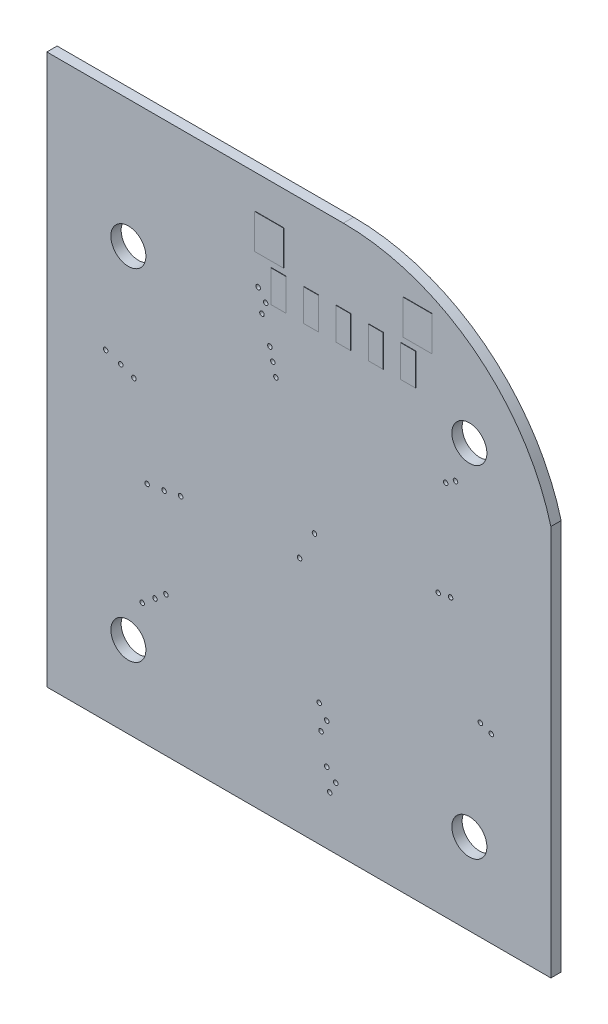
ISO-10303-21;
HEADER;
FILE_DESCRIPTION(('STEP AP214'),'2;1');
FILE_NAME('part.step','',(''),(''),'','','');
FILE_SCHEMA(('AUTOMOTIVE_DESIGN { 1 0 10303 214 1 1 1 1 }'));
ENDSEC;
DATA;
#1=APPLICATION_CONTEXT('core data for automotive mechanical design processes');
#2=APPLICATION_PROTOCOL_DEFINITION('international standard','automotive_design',2000,#1);
#3=PRODUCT_CONTEXT('',#1,'mechanical');
#4=PRODUCT('Part','Part','',(#3));
#5=PRODUCT_RELATED_PRODUCT_CATEGORY('part','',(#4));
#6=PRODUCT_DEFINITION_FORMATION('','',#4);
#7=PRODUCT_DEFINITION_CONTEXT('part definition',#1,'design');
#8=PRODUCT_DEFINITION('design','',#6,#7);
#9=PRODUCT_DEFINITION_SHAPE('','',#8);
#10=(LENGTH_UNIT() NAMED_UNIT(*) SI_UNIT(.MILLI.,.METRE.));
#11=(NAMED_UNIT(*) PLANE_ANGLE_UNIT() SI_UNIT($,.RADIAN.));
#12=(NAMED_UNIT(*) SI_UNIT($,.STERADIAN.) SOLID_ANGLE_UNIT());
#13=UNCERTAINTY_MEASURE_WITH_UNIT(LENGTH_MEASURE(1.E-05),#10,'distance_accuracy_value','');
#14=(GEOMETRIC_REPRESENTATION_CONTEXT(3) GLOBAL_UNCERTAINTY_ASSIGNED_CONTEXT((#13)) GLOBAL_UNIT_ASSIGNED_CONTEXT((#10,
#11,#12)) REPRESENTATION_CONTEXT('',''));
#15=CARTESIAN_POINT('',(0.,0.,0.));
#16=DIRECTION('',(0.,0.,1.));
#17=DIRECTION('',(1.,0.,0.));
#18=AXIS2_PLACEMENT_3D('',#15,#16,#17);
#19=CARTESIAN_POINT('',(3.00078845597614,5.5993386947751,0.69342));
#20=DIRECTION('',(0.,0.,1.));
#21=DIRECTION('',(1.,0.,0.));
#22=AXIS2_PLACEMENT_3D('',#19,#20,#21);
#23=PLANE('',#22);
#24=DIRECTION('',(1.,0.,0.));
#25=VECTOR('',#24,1.);
#26=CARTESIAN_POINT('',(6.8961,15.07236,0.69342));
#27=LINE('',#26,#25);
#28=CARTESIAN_POINT('',(6.8961,15.07236,0.69342));
#29=VERTEX_POINT('',#28);
#30=CARTESIAN_POINT('',(7.89686,15.07236,0.69342));
#31=VERTEX_POINT('',#30);
#32=EDGE_CURVE('P0_E261',#29,#31,#27,.T.);
#33=ORIENTED_EDGE('',*,*,#32,.T.);
#34=DIRECTION('',(0.,-1.,0.));
#35=VECTOR('',#34,1.);
#36=CARTESIAN_POINT('',(7.89686,15.07236,0.69342));
#37=LINE('',#36,#35);
#38=CARTESIAN_POINT('',(7.89686,12.92352,0.69342));
#39=VERTEX_POINT('',#38);
#40=EDGE_CURVE('P0_E237',#31,#39,#37,.T.);
#41=ORIENTED_EDGE('',*,*,#40,.T.);
#42=DIRECTION('',(-1.,0.,0.));
#43=VECTOR('',#42,1.);
#44=CARTESIAN_POINT('',(7.89686,12.92352,0.69342));
#45=LINE('',#44,#43);
#46=CARTESIAN_POINT('',(6.8961,12.92352,0.69342));
#47=VERTEX_POINT('',#46);
#48=EDGE_CURVE('P0_E37',#39,#47,#45,.T.);
#49=ORIENTED_EDGE('',*,*,#48,.T.);
#50=DIRECTION('',(0.,1.,0.));
#51=VECTOR('',#50,1.);
#52=CARTESIAN_POINT('',(6.8961,12.92352,0.69342));
#53=LINE('',#52,#51);
#54=EDGE_CURVE('P0_E32',#47,#29,#53,.T.);
#55=ORIENTED_EDGE('',*,*,#54,.T.);
#56=EDGE_LOOP('',(#33,#41,#49,#55));
#57=FACE_BOUND('',#56,.T.);
#58=DIRECTION('',(0.,1.,0.));
#59=VECTOR('',#58,1.);
#60=CARTESIAN_POINT('',(7.0485,15.47622,0.69342));
#61=LINE('',#60,#59);
#62=CARTESIAN_POINT('',(7.0485,15.47622,0.69342));
#63=VERTEX_POINT('',#62);
#64=CARTESIAN_POINT('',(7.0485,17.8181,0.69342));
#65=VERTEX_POINT('',#64);
#66=EDGE_CURVE('P0_E266',#63,#65,#61,.T.);
#67=ORIENTED_EDGE('',*,*,#66,.T.);
#68=DIRECTION('',(1.,0.,0.));
#69=VECTOR('',#68,1.);
#70=CARTESIAN_POINT('',(7.0485,17.8181,0.69342));
#71=LINE('',#70,#69);
#72=CARTESIAN_POINT('',(8.99668,17.8181,0.69342));
#73=VERTEX_POINT('',#72);
#74=EDGE_CURVE('P0_E285',#65,#73,#71,.T.);
#75=ORIENTED_EDGE('',*,*,#74,.T.);
#76=DIRECTION('',(0.,-1.,0.));
#77=VECTOR('',#76,1.);
#78=CARTESIAN_POINT('',(8.99668,17.8181,0.69342));
#79=LINE('',#78,#77);
#80=CARTESIAN_POINT('',(8.99668,15.47622,0.69342));
#81=VERTEX_POINT('',#80);
#82=EDGE_CURVE('P0_E287',#73,#81,#79,.T.);
#83=ORIENTED_EDGE('',*,*,#82,.T.);
#84=DIRECTION('',(-1.,0.,0.));
#85=VECTOR('',#84,1.);
#86=CARTESIAN_POINT('',(8.99668,15.47622,0.69342));
#87=LINE('',#86,#85);
#88=EDGE_CURVE('P0_E274',#81,#63,#87,.T.);
#89=ORIENTED_EDGE('',*,*,#88,.T.);
#90=EDGE_LOOP('',(#67,#75,#83,#89));
#91=FACE_BOUND('',#90,.T.);
#92=DIRECTION('',(0.,1.,0.));
#93=VECTOR('',#92,1.);
#94=CARTESIAN_POINT('',(2.52222,12.92352,0.69342));
#95=LINE('',#94,#93);
#96=CARTESIAN_POINT('',(2.52222,12.92352,0.69342));
#97=VERTEX_POINT('',#96);
#98=CARTESIAN_POINT('',(2.52222,15.07236,0.69342));
#99=VERTEX_POINT('',#98);
#100=EDGE_CURVE('P0_E293',#97,#99,#95,.T.);
#101=ORIENTED_EDGE('',*,*,#100,.T.);
#102=DIRECTION('',(1.,0.,0.));
#103=VECTOR('',#102,1.);
#104=CARTESIAN_POINT('',(2.52222,15.07236,0.69342));
#105=LINE('',#104,#103);
#106=CARTESIAN_POINT('',(3.52298,15.07236,0.69342));
#107=VERTEX_POINT('',#106);
#108=EDGE_CURVE('P0_E317',#99,#107,#105,.T.);
#109=ORIENTED_EDGE('',*,*,#108,.T.);
#110=DIRECTION('',(0.,-1.,0.));
#111=VECTOR('',#110,1.);
#112=CARTESIAN_POINT('',(3.52298,15.07236,0.69342));
#113=LINE('',#112,#111);
#114=CARTESIAN_POINT('',(3.52298,12.92352,0.69342));
#115=VERTEX_POINT('',#114);
#116=EDGE_CURVE('P0_E319',#107,#115,#113,.T.);
#117=ORIENTED_EDGE('',*,*,#116,.T.);
#118=DIRECTION('',(-1.,0.,0.));
#119=VECTOR('',#118,1.);
#120=CARTESIAN_POINT('',(3.52298,12.92352,0.69342));
#121=LINE('',#120,#119);
#122=EDGE_CURVE('P0_E306',#115,#97,#121,.T.);
#123=ORIENTED_EDGE('',*,*,#122,.T.);
#124=EDGE_LOOP('',(#101,#109,#117,#123));
#125=FACE_BOUND('',#124,.T.);
#126=DIRECTION('',(1.,0.,0.));
#127=VECTOR('',#126,1.);
#128=CARTESIAN_POINT('',(0.33528,15.07236,0.69342));
#129=LINE('',#128,#127);
#130=CARTESIAN_POINT('',(0.33528,15.07236,0.69342));
#131=VERTEX_POINT('',#130);
#132=CARTESIAN_POINT('',(1.33604,15.07236,0.69342));
#133=VERTEX_POINT('',#132);
#134=EDGE_CURVE('P0_E325',#131,#133,#129,.T.);
#135=ORIENTED_EDGE('',*,*,#134,.T.);
#136=DIRECTION('',(0.,-1.,0.));
#137=VECTOR('',#136,1.);
#138=CARTESIAN_POINT('',(1.33604,15.07236,0.69342));
#139=LINE('',#138,#137);
#140=CARTESIAN_POINT('',(1.33604,12.92352,0.69342));
#141=VERTEX_POINT('',#140);
#142=EDGE_CURVE('P0_E349',#133,#141,#139,.T.);
#143=ORIENTED_EDGE('',*,*,#142,.T.);
#144=DIRECTION('',(-1.,0.,0.));
#145=VECTOR('',#144,1.);
#146=CARTESIAN_POINT('',(1.33604,12.92352,0.69342));
#147=LINE('',#146,#145);
#148=CARTESIAN_POINT('',(0.33528,12.92352,0.69342));
#149=VERTEX_POINT('',#148);
#150=EDGE_CURVE('P0_E351',#141,#149,#147,.T.);
#151=ORIENTED_EDGE('',*,*,#150,.T.);
#152=DIRECTION('',(0.,1.,0.));
#153=VECTOR('',#152,1.);
#154=CARTESIAN_POINT('',(0.33528,12.92352,0.69342));
#155=LINE('',#154,#153);
#156=EDGE_CURVE('P0_E338',#149,#131,#155,.T.);
#157=ORIENTED_EDGE('',*,*,#156,.T.);
#158=EDGE_LOOP('',(#135,#143,#151,#157));
#159=FACE_BOUND('',#158,.T.);
#160=DIRECTION('',(1.,0.,0.));
#161=VECTOR('',#160,1.);
#162=CARTESIAN_POINT('',(-1.85166,15.07236,0.69342));
#163=LINE('',#162,#161);
#164=CARTESIAN_POINT('',(-1.85166,15.07236,0.69342));
#165=VERTEX_POINT('',#164);
#166=CARTESIAN_POINT('',(-0.8509,15.07236,0.69342));
#167=VERTEX_POINT('',#166);
#168=EDGE_CURVE('P0_E357',#165,#167,#163,.T.);
#169=ORIENTED_EDGE('',*,*,#168,.T.);
#170=DIRECTION('',(0.,-1.,0.));
#171=VECTOR('',#170,1.);
#172=CARTESIAN_POINT('',(-0.8509,15.07236,0.69342));
#173=LINE('',#172,#171);
#174=CARTESIAN_POINT('',(-0.8509,12.92352,0.69342));
#175=VERTEX_POINT('',#174);
#176=EDGE_CURVE('P0_E381',#167,#175,#173,.T.);
#177=ORIENTED_EDGE('',*,*,#176,.T.);
#178=DIRECTION('',(-1.,0.,0.));
#179=VECTOR('',#178,1.);
#180=CARTESIAN_POINT('',(-0.8509,12.92352,0.69342));
#181=LINE('',#180,#179);
#182=CARTESIAN_POINT('',(-1.85166,12.92352,0.69342));
#183=VERTEX_POINT('',#182);
#184=EDGE_CURVE('P0_E383',#175,#183,#181,.T.);
#185=ORIENTED_EDGE('',*,*,#184,.T.);
#186=DIRECTION('',(0.,1.,0.));
#187=VECTOR('',#186,1.);
#188=CARTESIAN_POINT('',(-1.85166,12.92352,0.69342));
#189=LINE('',#188,#187);
#190=EDGE_CURVE('P0_E370',#183,#165,#189,.T.);
#191=ORIENTED_EDGE('',*,*,#190,.T.);
#192=EDGE_LOOP('',(#169,#177,#185,#191));
#193=FACE_BOUND('',#192,.T.);
#194=DIRECTION('',(1.,0.,0.));
#195=VECTOR('',#194,1.);
#196=CARTESIAN_POINT('',(-2.95148,17.8181,0.69342));
#197=LINE('',#196,#195);
#198=CARTESIAN_POINT('',(-2.95148,17.8181,0.69342));
#199=VERTEX_POINT('',#198);
#200=CARTESIAN_POINT('',(-1.0033,17.8181,0.69342));
#201=VERTEX_POINT('',#200);
#202=EDGE_CURVE('P0_E389',#199,#201,#197,.T.);
#203=ORIENTED_EDGE('',*,*,#202,.T.);
#204=DIRECTION('',(0.,-1.,0.));
#205=VECTOR('',#204,1.);
#206=CARTESIAN_POINT('',(-1.0033,17.8181,0.69342));
#207=LINE('',#206,#205);
#208=CARTESIAN_POINT('',(-1.0033,15.47622,0.69342));
#209=VERTEX_POINT('',#208);
#210=EDGE_CURVE('P0_E413',#201,#209,#207,.T.);
#211=ORIENTED_EDGE('',*,*,#210,.T.);
#212=DIRECTION('',(-1.,0.,0.));
#213=VECTOR('',#212,1.);
#214=CARTESIAN_POINT('',(-1.0033,15.47622,0.69342));
#215=LINE('',#214,#213);
#216=CARTESIAN_POINT('',(-2.95148,15.47622,0.69342));
#217=VERTEX_POINT('',#216);
#218=EDGE_CURVE('P0_E415',#209,#217,#215,.T.);
#219=ORIENTED_EDGE('',*,*,#218,.T.);
#220=DIRECTION('',(0.,1.,0.));
#221=VECTOR('',#220,1.);
#222=CARTESIAN_POINT('',(-2.95148,15.47622,0.69342));
#223=LINE('',#222,#221);
#224=EDGE_CURVE('P0_E402',#217,#199,#223,.T.);
#225=ORIENTED_EDGE('',*,*,#224,.T.);
#226=EDGE_LOOP('',(#203,#211,#219,#225));
#227=FACE_BOUND('',#226,.T.);
#228=CARTESIAN_POINT('',(-1.5494,8.8138,0.69342));
#229=DIRECTION('',(0.,0.,1.));
#230=DIRECTION('',(1.,0.,0.));
#231=AXIS2_PLACEMENT_3D('',#228,#229,#230);
#232=CIRCLE('',#231,0.1524);
#233=CARTESIAN_POINT('',(-1.397,8.8138,0.69342));
#234=VERTEX_POINT('',#233);
#235=EDGE_CURVE('P0_E586',#234,#234,#232,.T.);
#236=ORIENTED_EDGE('',*,*,#235,.F.);
#237=EDGE_LOOP('',(#236));
#238=FACE_BOUND('',#237,.T.);
#239=CARTESIAN_POINT('',(-1.9558,10.414,0.69342));
#240=DIRECTION('',(0.,0.,1.));
#241=DIRECTION('',(1.,0.,0.));
#242=AXIS2_PLACEMENT_3D('',#239,#240,#241);
#243=CIRCLE('',#242,0.1524);
#244=CARTESIAN_POINT('',(-1.8034,10.414,0.69342));
#245=VERTEX_POINT('',#244);
#246=EDGE_CURVE('P0_E579',#245,#245,#243,.T.);
#247=ORIENTED_EDGE('',*,*,#246,.F.);
#248=EDGE_LOOP('',(#247));
#249=FACE_BOUND('',#248,.T.);
#250=CARTESIAN_POINT('',(-1.7526,9.6266,0.69342));
#251=DIRECTION('',(0.,0.,1.));
#252=DIRECTION('',(1.,0.,0.));
#253=AXIS2_PLACEMENT_3D('',#250,#251,#252);
#254=CIRCLE('',#253,0.1524);
#255=CARTESIAN_POINT('',(-1.6002,9.6266,0.69342));
#256=VERTEX_POINT('',#255);
#257=EDGE_CURVE('P0_E598',#256,#256,#254,.T.);
#258=ORIENTED_EDGE('',*,*,#257,.F.);
#259=EDGE_LOOP('',(#258));
#260=FACE_BOUND('',#259,.T.);
#261=CARTESIAN_POINT('',(1.4986,-10.3378,0.69342));
#262=DIRECTION('',(0.,0.,1.));
#263=DIRECTION('',(1.,0.,0.));
#264=AXIS2_PLACEMENT_3D('',#261,#262,#263);
#265=CIRCLE('',#264,0.1524);
#266=CARTESIAN_POINT('',(1.651,-10.3378,0.69342));
#267=VERTEX_POINT('',#266);
#268=EDGE_CURVE('P0_E591',#267,#267,#265,.T.);
#269=ORIENTED_EDGE('',*,*,#268,.F.);
#270=EDGE_LOOP('',(#269));
#271=FACE_BOUND('',#270,.T.);
#272=CARTESIAN_POINT('',(-11.1252,3.9878,0.69342));
#273=DIRECTION('',(0.,0.,1.));
#274=DIRECTION('',(1.,0.,0.));
#275=AXIS2_PLACEMENT_3D('',#272,#273,#274);
#276=CIRCLE('',#275,0.1524);
#277=CARTESIAN_POINT('',(-10.9728,3.9878,0.69342));
#278=VERTEX_POINT('',#277);
#279=EDGE_CURVE('P0_E555',#278,#278,#276,.T.);
#280=ORIENTED_EDGE('',*,*,#279,.F.);
#281=EDGE_LOOP('',(#280));
#282=FACE_BOUND('',#281,.T.);
#283=CARTESIAN_POINT('',(-10.5664,-8.8646,0.69342));
#284=DIRECTION('',(0.,0.,1.));
#285=DIRECTION('',(1.,0.,0.));
#286=AXIS2_PLACEMENT_3D('',#283,#284,#285);
#287=CIRCLE('',#286,0.1524);
#288=CARTESIAN_POINT('',(-10.414,-8.8646,0.69342));
#289=VERTEX_POINT('',#288);
#290=EDGE_CURVE('P0_E562',#289,#289,#287,.T.);
#291=ORIENTED_EDGE('',*,*,#290,.F.);
#292=EDGE_LOOP('',(#291));
#293=FACE_BOUND('',#292,.T.);
#294=CARTESIAN_POINT('',(-2.4892,12.065,0.69342));
#295=DIRECTION('',(0.,0.,1.));
#296=DIRECTION('',(1.,0.,0.));
#297=AXIS2_PLACEMENT_3D('',#294,#295,#296);
#298=CIRCLE('',#297,0.1524);
#299=CARTESIAN_POINT('',(-2.3368,12.065,0.69342));
#300=VERTEX_POINT('',#299);
#301=EDGE_CURVE('P0_E568',#300,#300,#298,.T.);
#302=ORIENTED_EDGE('',*,*,#301,.F.);
#303=EDGE_LOOP('',(#302));
#304=FACE_BOUND('',#303,.T.);
#305=CARTESIAN_POINT('',(1.8796,-12.2174,0.69342));
#306=DIRECTION('',(0.,0.,1.));
#307=DIRECTION('',(1.,0.,0.));
#308=AXIS2_PLACEMENT_3D('',#305,#306,#307);
#309=CIRCLE('',#308,0.1524);
#310=CARTESIAN_POINT('',(2.032,-12.2174,0.69342));
#311=VERTEX_POINT('',#310);
#312=EDGE_CURVE('P0_E574',#311,#311,#309,.T.);
#313=ORIENTED_EDGE('',*,*,#312,.F.);
#314=EDGE_LOOP('',(#313));
#315=FACE_BOUND('',#314,.T.);
#316=CARTESIAN_POINT('',(-10.2362,-1.7526,0.69342));
#317=DIRECTION('',(0.,0.,1.));
#318=DIRECTION('',(1.,0.,0.));
#319=AXIS2_PLACEMENT_3D('',#316,#317,#318);
#320=CIRCLE('',#319,0.1524);
#321=CARTESIAN_POINT('',(-10.0838,-1.7526,0.69342));
#322=VERTEX_POINT('',#321);
#323=EDGE_CURVE('P0_E634',#322,#322,#320,.T.);
#324=ORIENTED_EDGE('',*,*,#323,.F.);
#325=EDGE_LOOP('',(#324));
#326=FACE_BOUND('',#325,.T.);
#327=CARTESIAN_POINT('',(1.8796,-9.525,0.69342));
#328=DIRECTION('',(0.,0.,1.));
#329=DIRECTION('',(1.,0.,0.));
#330=AXIS2_PLACEMENT_3D('',#327,#328,#329);
#331=CIRCLE('',#330,0.1524);
#332=CARTESIAN_POINT('',(2.032,-9.525,0.69342));
#333=VERTEX_POINT('',#332);
#334=EDGE_CURVE('P0_E627',#333,#333,#331,.T.);
#335=ORIENTED_EDGE('',*,*,#334,.F.);
#336=EDGE_LOOP('',(#335));
#337=FACE_BOUND('',#336,.T.);
#338=CARTESIAN_POINT('',(1.3716,-8.7376,0.69342));
#339=DIRECTION('',(0.,0.,1.));
#340=DIRECTION('',(1.,0.,0.));
#341=AXIS2_PLACEMENT_3D('',#338,#339,#340);
#342=CIRCLE('',#341,0.1524);
#343=CARTESIAN_POINT('',(1.524,-8.7376,0.69342));
#344=VERTEX_POINT('',#343);
#345=EDGE_CURVE('P0_E646',#344,#344,#342,.T.);
#346=ORIENTED_EDGE('',*,*,#345,.F.);
#347=EDGE_LOOP('',(#346));
#348=FACE_BOUND('',#347,.T.);
#349=CARTESIAN_POINT('',(0.05334,-0.9398,0.69342));
#350=DIRECTION('',(0.,0.,1.));
#351=DIRECTION('',(1.,0.,0.));
#352=AXIS2_PLACEMENT_3D('',#349,#350,#351);
#353=CIRCLE('',#352,0.1524);
#354=CARTESIAN_POINT('',(0.20574,-0.9398,0.69342));
#355=VERTEX_POINT('',#354);
#356=EDGE_CURVE('P0_E639',#355,#355,#353,.T.);
#357=ORIENTED_EDGE('',*,*,#356,.F.);
#358=EDGE_LOOP('',(#357));
#359=FACE_BOUND('',#358,.T.);
#360=CARTESIAN_POINT('',(-9.0932,-1.5748,0.69342));
#361=DIRECTION('',(0.,0.,1.));
#362=DIRECTION('',(1.,0.,0.));
#363=AXIS2_PLACEMENT_3D('',#360,#361,#362);
#364=CIRCLE('',#363,0.1524);
#365=CARTESIAN_POINT('',(-8.9408,-1.5748,0.69342));
#366=VERTEX_POINT('',#365);
#367=EDGE_CURVE('P0_E603',#366,#366,#364,.T.);
#368=ORIENTED_EDGE('',*,*,#367,.F.);
#369=EDGE_LOOP('',(#368));
#370=FACE_BOUND('',#369,.T.);
#371=CARTESIAN_POINT('',(-7.9756,-1.3462,0.69342));
#372=DIRECTION('',(0.,0.,1.));
#373=DIRECTION('',(1.,0.,0.));
#374=AXIS2_PLACEMENT_3D('',#371,#372,#373);
#375=CIRCLE('',#374,0.1524);
#376=CARTESIAN_POINT('',(-7.8232,-1.3462,0.69342));
#377=VERTEX_POINT('',#376);
#378=EDGE_CURVE('P0_E610',#377,#377,#375,.T.);
#379=ORIENTED_EDGE('',*,*,#378,.F.);
#380=EDGE_LOOP('',(#379));
#381=FACE_BOUND('',#380,.T.);
#382=CARTESIAN_POINT('',(9.398,1.7018,0.69342));
#383=DIRECTION('',(0.,0.,1.));
#384=DIRECTION('',(1.,0.,0.));
#385=AXIS2_PLACEMENT_3D('',#382,#383,#384);
#386=CIRCLE('',#385,0.1524);
#387=CARTESIAN_POINT('',(9.5504,1.7018,0.69342));
#388=VERTEX_POINT('',#387);
#389=EDGE_CURVE('P0_E616',#388,#388,#386,.T.);
#390=ORIENTED_EDGE('',*,*,#389,.F.);
#391=EDGE_LOOP('',(#390));
#392=FACE_BOUND('',#391,.T.);
#393=CARTESIAN_POINT('',(10.2362,1.8542,0.69342));
#394=DIRECTION('',(0.,0.,1.));
#395=DIRECTION('',(1.,0.,0.));
#396=AXIS2_PLACEMENT_3D('',#393,#394,#395);
#397=CIRCLE('',#396,0.1524);
#398=CARTESIAN_POINT('',(10.3886,1.8542,0.69342));
#399=VERTEX_POINT('',#398);
#400=EDGE_CURVE('P0_E622',#399,#399,#397,.T.);
#401=ORIENTED_EDGE('',*,*,#400,.F.);
#402=EDGE_LOOP('',(#401));
#403=FACE_BOUND('',#402,.T.);
#404=CARTESIAN_POINT('',(2.4892,-12.8524,0.69342));
#405=DIRECTION('',(0.,0.,1.));
#406=DIRECTION('',(1.,0.,0.));
#407=AXIS2_PLACEMENT_3D('',#404,#405,#406);
#408=CIRCLE('',#407,0.1524);
#409=CARTESIAN_POINT('',(2.6416,-12.8524,0.69342));
#410=VERTEX_POINT('',#409);
#411=EDGE_CURVE('P0_E483',#410,#410,#408,.T.);
#412=ORIENTED_EDGE('',*,*,#411,.F.);
#413=EDGE_LOOP('',(#412));
#414=FACE_BOUND('',#413,.T.);
#415=CARTESIAN_POINT('',(2.0828,-13.6144,0.69342));
#416=DIRECTION('',(0.,0.,1.));
#417=DIRECTION('',(1.,0.,0.));
#418=AXIS2_PLACEMENT_3D('',#415,#416,#417);
#419=CIRCLE('',#418,0.1524);
#420=CARTESIAN_POINT('',(2.2352,-13.6144,0.69342));
#421=VERTEX_POINT('',#420);
#422=EDGE_CURVE('P0_E490',#421,#421,#419,.T.);
#423=ORIENTED_EDGE('',*,*,#422,.F.);
#424=EDGE_LOOP('',(#423));
#425=FACE_BOUND('',#424,.T.);
#426=CARTESIAN_POINT('',(-12.0142,4.3434,0.69342));
#427=DIRECTION('',(0.,0.,1.));
#428=DIRECTION('',(1.,0.,0.));
#429=AXIS2_PLACEMENT_3D('',#426,#427,#428);
#430=CIRCLE('',#429,0.1524);
#431=CARTESIAN_POINT('',(-11.8618,4.3434,0.69342));
#432=VERTEX_POINT('',#431);
#433=EDGE_CURVE('P0_E496',#432,#432,#430,.T.);
#434=ORIENTED_EDGE('',*,*,#433,.F.);
#435=EDGE_LOOP('',(#434));
#436=FACE_BOUND('',#435,.T.);
#437=CARTESIAN_POINT('',(-13.0302,4.6736,0.69342));
#438=DIRECTION('',(0.,0.,1.));
#439=DIRECTION('',(1.,0.,0.));
#440=AXIS2_PLACEMENT_3D('',#437,#438,#439);
#441=CIRCLE('',#440,0.1524);
#442=CARTESIAN_POINT('',(-12.8778,4.6736,0.69342));
#443=VERTEX_POINT('',#442);
#444=EDGE_CURVE('P0_E502',#443,#443,#441,.T.);
#445=ORIENTED_EDGE('',*,*,#444,.F.);
#446=EDGE_LOOP('',(#445));
#447=FACE_BOUND('',#446,.T.);
#448=CARTESIAN_POINT('',(-11.50112,-11.50112,0.69342));
#449=DIRECTION('',(0.,0.,1.));
#450=DIRECTION('',(1.,0.,0.));
#451=AXIS2_PLACEMENT_3D('',#448,#449,#450);
#452=CIRCLE('',#451,1.1811);
#453=CARTESIAN_POINT('',(-10.32002,-11.50112,0.69342));
#454=VERTEX_POINT('',#453);
#455=EDGE_CURVE('P0_E459',#454,#454,#452,.T.);
#456=ORIENTED_EDGE('',*,*,#455,.F.);
#457=EDGE_LOOP('',(#456));
#458=FACE_BOUND('',#457,.T.);
#459=CARTESIAN_POINT('',(11.50112,-11.50112,0.69342));
#460=DIRECTION('',(0.,0.,1.));
#461=DIRECTION('',(1.,0.,0.));
#462=AXIS2_PLACEMENT_3D('',#459,#460,#461);
#463=CIRCLE('',#462,1.1811);
#464=CARTESIAN_POINT('',(12.68222,-11.50112,0.69342));
#465=VERTEX_POINT('',#464);
#466=EDGE_CURVE('P0_E466',#465,#465,#463,.T.);
#467=ORIENTED_EDGE('',*,*,#466,.F.);
#468=EDGE_LOOP('',(#467));
#469=FACE_BOUND('',#468,.T.);
#470=CARTESIAN_POINT('',(11.50112,11.50112,0.69342));
#471=DIRECTION('',(0.,0.,1.));
#472=DIRECTION('',(1.,0.,0.));
#473=AXIS2_PLACEMENT_3D('',#470,#471,#472);
#474=CIRCLE('',#473,1.1811);
#475=CARTESIAN_POINT('',(12.68222,11.50112,0.69342));
#476=VERTEX_POINT('',#475);
#477=EDGE_CURVE('P0_E472',#476,#476,#474,.T.);
#478=ORIENTED_EDGE('',*,*,#477,.F.);
#479=EDGE_LOOP('',(#478));
#480=FACE_BOUND('',#479,.T.);
#481=CARTESIAN_POINT('',(-11.50112,11.50112,0.69342));
#482=DIRECTION('',(0.,0.,1.));
#483=DIRECTION('',(1.,0.,0.));
#484=AXIS2_PLACEMENT_3D('',#481,#482,#483);
#485=CIRCLE('',#484,1.1811);
#486=CARTESIAN_POINT('',(-10.32002,11.50112,0.69342));
#487=VERTEX_POINT('',#486);
#488=EDGE_CURVE('P0_E478',#487,#487,#485,.T.);
#489=ORIENTED_EDGE('',*,*,#488,.F.);
#490=EDGE_LOOP('',(#489));
#491=FACE_BOUND('',#490,.T.);
#492=CARTESIAN_POINT('',(9.906,8.382,0.69342));
#493=DIRECTION('',(0.,0.,1.));
#494=DIRECTION('',(1.,0.,0.));
#495=AXIS2_PLACEMENT_3D('',#492,#493,#494);
#496=CIRCLE('',#495,0.1524);
#497=CARTESIAN_POINT('',(10.0584,8.382,0.69342));
#498=VERTEX_POINT('',#497);
#499=EDGE_CURVE('P0_E550',#498,#498,#496,.T.);
#500=ORIENTED_EDGE('',*,*,#499,.F.);
#501=EDGE_LOOP('',(#500));
#502=FACE_BOUND('',#501,.T.);
#503=CARTESIAN_POINT('',(10.5664,8.8138,0.69342));
#504=DIRECTION('',(0.,0.,1.));
#505=DIRECTION('',(1.,0.,0.));
#506=AXIS2_PLACEMENT_3D('',#503,#504,#505);
#507=CIRCLE('',#506,0.1524);
#508=CARTESIAN_POINT('',(10.7188,8.8138,0.69342));
#509=VERTEX_POINT('',#508);
#510=EDGE_CURVE('P0_E544',#509,#509,#507,.T.);
#511=ORIENTED_EDGE('',*,*,#510,.F.);
#512=EDGE_LOOP('',(#511));
#513=FACE_BOUND('',#512,.T.);
#514=CARTESIAN_POINT('',(12.9794,-4.7498,0.69342));
#515=DIRECTION('',(0.,0.,1.));
#516=DIRECTION('',(1.,0.,0.));
#517=AXIS2_PLACEMENT_3D('',#514,#515,#516);
#518=CIRCLE('',#517,0.1524);
#519=CARTESIAN_POINT('',(13.1318,-4.7498,0.69342));
#520=VERTEX_POINT('',#519);
#521=EDGE_CURVE('P0_E538',#520,#520,#518,.T.);
#522=ORIENTED_EDGE('',*,*,#521,.F.);
#523=EDGE_LOOP('',(#522));
#524=FACE_BOUND('',#523,.T.);
#525=CARTESIAN_POINT('',(12.2428,-4.4704,0.69342));
#526=DIRECTION('',(0.,0.,1.));
#527=DIRECTION('',(1.,0.,0.));
#528=AXIS2_PLACEMENT_3D('',#525,#526,#527);
#529=CIRCLE('',#528,0.1524);
#530=CARTESIAN_POINT('',(12.3952,-4.4704,0.69342));
#531=VERTEX_POINT('',#530);
#532=EDGE_CURVE('P0_E532',#531,#531,#529,.T.);
#533=ORIENTED_EDGE('',*,*,#532,.F.);
#534=EDGE_LOOP('',(#533));
#535=FACE_BOUND('',#534,.T.);
#536=CARTESIAN_POINT('',(-2.7432,13.4874,0.69342));
#537=DIRECTION('',(0.,0.,1.));
#538=DIRECTION('',(1.,0.,0.));
#539=AXIS2_PLACEMENT_3D('',#536,#537,#538);
#540=CIRCLE('',#539,0.1524);
#541=CARTESIAN_POINT('',(-2.5908,13.4874,0.69342));
#542=VERTEX_POINT('',#541);
#543=EDGE_CURVE('P0_E526',#542,#542,#540,.T.);
#544=ORIENTED_EDGE('',*,*,#543,.F.);
#545=EDGE_LOOP('',(#544));
#546=FACE_BOUND('',#545,.T.);
#547=CARTESIAN_POINT('',(-2.2352,12.827,0.69342));
#548=DIRECTION('',(0.,0.,1.));
#549=DIRECTION('',(1.,0.,0.));
#550=AXIS2_PLACEMENT_3D('',#547,#548,#549);
#551=CIRCLE('',#550,0.1524);
#552=CARTESIAN_POINT('',(-2.0828,12.827,0.69342));
#553=VERTEX_POINT('',#552);
#554=EDGE_CURVE('P0_E520',#553,#553,#551,.T.);
#555=ORIENTED_EDGE('',*,*,#554,.F.);
#556=EDGE_LOOP('',(#555));
#557=FACE_BOUND('',#556,.T.);
#558=CARTESIAN_POINT('',(-9.7028,-8.1788,0.69342));
#559=DIRECTION('',(0.,0.,1.));
#560=DIRECTION('',(1.,0.,0.));
#561=AXIS2_PLACEMENT_3D('',#558,#559,#560);
#562=CIRCLE('',#561,0.1524);
#563=CARTESIAN_POINT('',(-9.5504,-8.1788,0.69342));
#564=VERTEX_POINT('',#563);
#565=EDGE_CURVE('P0_E514',#564,#564,#562,.T.);
#566=ORIENTED_EDGE('',*,*,#565,.F.);
#567=EDGE_LOOP('',(#566));
#568=FACE_BOUND('',#567,.T.);
#569=CARTESIAN_POINT('',(-8.9662,-7.5692,0.69342));
#570=DIRECTION('',(0.,0.,1.));
#571=DIRECTION('',(1.,0.,0.));
#572=AXIS2_PLACEMENT_3D('',#569,#570,#571);
#573=CIRCLE('',#572,0.1524);
#574=CARTESIAN_POINT('',(-8.8138,-7.5692,0.69342));
#575=VERTEX_POINT('',#574);
#576=EDGE_CURVE('P0_E507',#575,#575,#573,.T.);
#577=ORIENTED_EDGE('',*,*,#576,.F.);
#578=EDGE_LOOP('',(#577));
#579=FACE_BOUND('',#578,.T.);
#580=CARTESIAN_POINT('',(1.0541,0.9906,0.69342));
#581=DIRECTION('',(0.,0.,1.));
#582=DIRECTION('',(1.,0.,0.));
#583=AXIS2_PLACEMENT_3D('',#580,#581,#582);
#584=CIRCLE('',#583,0.1524);
#585=CARTESIAN_POINT('',(1.2065,0.9906,0.69342));
#586=VERTEX_POINT('',#585);
#587=EDGE_CURVE('P0_E651',#586,#586,#584,.T.);
#588=ORIENTED_EDGE('',*,*,#587,.F.);
#589=EDGE_LOOP('',(#588));
#590=FACE_BOUND('',#589,.T.);
#591=DIRECTION('',(0.,-1.,0.));
#592=VECTOR('',#591,1.);
#593=CARTESIAN_POINT('',(-17.00022,20.09902,0.69342));
#594=LINE('',#593,#592);
#595=CARTESIAN_POINT('',(-17.00022,20.09902,0.69342));
#596=VERTEX_POINT('',#595);
#597=CARTESIAN_POINT('',(-17.00022,-17.00022,0.69342));
#598=VERTEX_POINT('',#597);
#599=EDGE_CURVE('P0_E657',#596,#598,#594,.T.);
#600=ORIENTED_EDGE('',*,*,#599,.T.);
#601=DIRECTION('',(1.,0.,0.));
#602=VECTOR('',#601,1.);
#603=CARTESIAN_POINT('',(-17.00022,-17.00022,0.69342));
#604=LINE('',#603,#602);
#605=CARTESIAN_POINT('',(17.00022,-17.00022,0.69342));
#606=VERTEX_POINT('',#605);
#607=EDGE_CURVE('P0_E660',#598,#606,#604,.T.);
#608=ORIENTED_EDGE('',*,*,#607,.T.);
#609=DIRECTION('',(0.,1.,0.));
#610=VECTOR('',#609,1.);
#611=CARTESIAN_POINT('',(17.00022,-17.00022,0.69342));
#612=LINE('',#611,#610);
#613=CARTESIAN_POINT('',(17.00022,9.37514,0.69342));
#614=VERTEX_POINT('',#613);
#615=EDGE_CURVE('P0_E663',#606,#614,#612,.T.);
#616=ORIENTED_EDGE('',*,*,#615,.T.);
#617=CARTESIAN_POINT('',(3.00078845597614,5.5993386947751,0.69342));
#618=DIRECTION('',(0.,0.,1.));
#619=DIRECTION('',(1.,0.,0.));
#620=AXIS2_PLACEMENT_3D('',#617,#618,#619);
#621=CIRCLE('',#620,14.4996813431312);
#622=CARTESIAN_POINT('',(2.99974,20.09902,0.69342));
#623=VERTEX_POINT('',#622);
#624=EDGE_CURVE('P0_E665',#614,#623,#621,.T.);
#625=ORIENTED_EDGE('',*,*,#624,.T.);
#626=DIRECTION('',(-1.,0.,0.));
#627=VECTOR('',#626,1.);
#628=CARTESIAN_POINT('',(2.99974,20.09902,0.69342));
#629=LINE('',#628,#627);
#630=EDGE_CURVE('P0_E667',#623,#596,#629,.T.);
#631=ORIENTED_EDGE('',*,*,#630,.T.);
#632=EDGE_LOOP('',(#600,#608,#616,#625,#631));
#633=FACE_BOUND('',#632,.T.);
#634=DIRECTION('',(0.,1.,0.));
#635=VECTOR('',#634,1.);
#636=CARTESIAN_POINT('',(5.70992,15.07236,0.69342));
#637=LINE('',#636,#635);
#638=CARTESIAN_POINT('',(5.70992,12.92352,0.69342));
#639=VERTEX_POINT('',#638);
#640=CARTESIAN_POINT('',(5.70992,15.07236,0.69342));
#641=VERTEX_POINT('',#640);
#642=EDGE_CURVE('P0_E443',#639,#641,#637,.T.);
#643=ORIENTED_EDGE('',*,*,#642,.F.);
#644=DIRECTION('',(1.,0.,0.));
#645=VECTOR('',#644,1.);
#646=CARTESIAN_POINT('',(5.70992,12.92352,0.69342));
#647=LINE('',#646,#645);
#648=CARTESIAN_POINT('',(4.70916,12.92352,0.69342));
#649=VERTEX_POINT('',#648);
#650=EDGE_CURVE('P0_E421',#649,#639,#647,.T.);
#651=ORIENTED_EDGE('',*,*,#650,.F.);
#652=DIRECTION('',(0.,-1.,0.));
#653=VECTOR('',#652,1.);
#654=CARTESIAN_POINT('',(4.70916,12.92352,0.69342));
#655=LINE('',#654,#653);
#656=CARTESIAN_POINT('',(4.70916,15.07236,0.69342));
#657=VERTEX_POINT('',#656);
#658=EDGE_CURVE('P0_E434',#657,#649,#655,.T.);
#659=ORIENTED_EDGE('',*,*,#658,.F.);
#660=DIRECTION('',(-1.,0.,0.));
#661=VECTOR('',#660,1.);
#662=CARTESIAN_POINT('',(4.70916,15.07236,0.69342));
#663=LINE('',#662,#661);
#664=EDGE_CURVE('P0_E445',#641,#657,#663,.T.);
#665=ORIENTED_EDGE('',*,*,#664,.F.);
#666=EDGE_LOOP('',(#643,#651,#659,#665));
#667=FACE_BOUND('',#666,.T.);
#668=ADVANCED_FACE('P0_F17',(#57,#91,#125,#159,#193,#227,#238,#249,#260,#271,#282,#293,#304,
#315,#326,#337,#348,#359,#370,#381,#392,#403,#414,#425,#436,#447,#458,#469,#480,#491,#502,#513,
#524,#535,#546,#557,#568,#579,#590,#633,#667),#23,.T.);
#669=CARTESIAN_POINT('',(-17.00022,20.09902,0.69342));
#670=DIRECTION('',(1.,0.,0.));
#671=DIRECTION('',(0.,0.,-1.));
#672=AXIS2_PLACEMENT_3D('',#669,#670,#671);
#673=PLANE('',#672);
#674=DIRECTION('',(0.,-1.,0.));
#675=VECTOR('',#674,1.);
#676=CARTESIAN_POINT('',(-17.00022,20.09902,0.));
#677=LINE('',#676,#675);
#678=CARTESIAN_POINT('',(-17.00022,20.09902,0.));
#679=VERTEX_POINT('',#678);
#680=CARTESIAN_POINT('',(-17.00022,-17.00022,0.));
#681=VERTEX_POINT('',#680);
#682=EDGE_CURVE('P0_E654',#679,#681,#677,.T.);
#683=ORIENTED_EDGE('',*,*,#682,.T.);
#684=DIRECTION('',(0.,0.,-1.));
#685=VECTOR('',#684,1.);
#686=CARTESIAN_POINT('',(-17.00022,-17.00022,0.69342));
#687=LINE('',#686,#685);
#688=EDGE_CURVE('P0_E11',#598,#681,#687,.T.);
#689=ORIENTED_EDGE('',*,*,#688,.F.);
#690=ORIENTED_EDGE('',*,*,#599,.F.);
#691=DIRECTION('',(0.,0.,-1.));
#692=VECTOR('',#691,1.);
#693=CARTESIAN_POINT('',(-17.00022,20.09902,0.69342));
#694=LINE('',#693,#692);
#695=EDGE_CURVE('P0_E669',#596,#679,#694,.T.);
#696=ORIENTED_EDGE('',*,*,#695,.T.);
#697=EDGE_LOOP('',(#683,#689,#690,#696));
#698=FACE_BOUND('',#697,.T.);
#699=ADVANCED_FACE('P0_F19',(#698),#673,.F.);
#700=CARTESIAN_POINT('',(-17.00022,-17.00022,0.69342));
#701=DIRECTION('',(0.,1.,0.));
#702=DIRECTION('',(0.,0.,1.));
#703=AXIS2_PLACEMENT_3D('',#700,#701,#702);
#704=PLANE('',#703);
#705=DIRECTION('',(1.,0.,0.));
#706=VECTOR('',#705,1.);
#707=CARTESIAN_POINT('',(-17.00022,-17.00022,0.));
#708=LINE('',#707,#706);
#709=CARTESIAN_POINT('',(17.00022,-17.00022,0.));
#710=VERTEX_POINT('',#709);
#711=EDGE_CURVE('P0_E672',#681,#710,#708,.T.);
#712=ORIENTED_EDGE('',*,*,#711,.T.);
#713=DIRECTION('',(0.,0.,-1.));
#714=VECTOR('',#713,1.);
#715=CARTESIAN_POINT('',(17.00022,-17.00022,0.69342));
#716=LINE('',#715,#714);
#717=EDGE_CURVE('P0_E25',#606,#710,#716,.T.);
#718=ORIENTED_EDGE('',*,*,#717,.F.);
#719=ORIENTED_EDGE('',*,*,#607,.F.);
#720=ORIENTED_EDGE('',*,*,#688,.T.);
#721=EDGE_LOOP('',(#712,#718,#719,#720));
#722=FACE_BOUND('',#721,.T.);
#723=ADVANCED_FACE('P0_F711',(#722),#704,.F.);
#724=CARTESIAN_POINT('',(17.00022,-17.00022,0.69342));
#725=DIRECTION('',(-1.,0.,0.));
#726=DIRECTION('',(0.,0.,1.));
#727=AXIS2_PLACEMENT_3D('',#724,#725,#726);
#728=PLANE('',#727);
#729=DIRECTION('',(0.,1.,0.));
#730=VECTOR('',#729,1.);
#731=CARTESIAN_POINT('',(17.00022,-17.00022,0.));
#732=LINE('',#731,#730);
#733=CARTESIAN_POINT('',(17.00022,9.37514,0.));
#734=VERTEX_POINT('',#733);
#735=EDGE_CURVE('P0_E674',#710,#734,#732,.T.);
#736=ORIENTED_EDGE('',*,*,#735,.T.);
#737=DIRECTION('',(0.,0.,-1.));
#738=VECTOR('',#737,1.);
#739=CARTESIAN_POINT('',(17.00022,9.37514,0.69342));
#740=LINE('',#739,#738);
#741=EDGE_CURVE('P0_E684',#614,#734,#740,.T.);
#742=ORIENTED_EDGE('',*,*,#741,.F.);
#743=ORIENTED_EDGE('',*,*,#615,.F.);
#744=ORIENTED_EDGE('',*,*,#717,.T.);
#745=EDGE_LOOP('',(#736,#742,#743,#744));
#746=FACE_BOUND('',#745,.T.);
#747=ADVANCED_FACE('P0_F691',(#746),#728,.F.);
#748=CARTESIAN_POINT('',(3.00078845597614,5.5993386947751,0.69342));
#749=DIRECTION('',(0.,0.,-1.));
#750=DIRECTION('',(-1.,0.,0.));
#751=AXIS2_PLACEMENT_3D('',#748,#749,#750);
#752=CYLINDRICAL_SURFACE('',#751,14.4996813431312);
#753=CARTESIAN_POINT('',(3.00078845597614,5.5993386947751,0.));
#754=DIRECTION('',(0.,0.,1.));
#755=DIRECTION('',(1.,0.,0.));
#756=AXIS2_PLACEMENT_3D('',#753,#754,#755);
#757=CIRCLE('',#756,14.4996813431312);
#758=CARTESIAN_POINT('',(2.99974,20.09902,0.));
#759=VERTEX_POINT('',#758);
#760=EDGE_CURVE('P0_E676',#734,#759,#757,.T.);
#761=ORIENTED_EDGE('',*,*,#760,.T.);
#762=DIRECTION('',(0.,0.,-1.));
#763=VECTOR('',#762,1.);
#764=CARTESIAN_POINT('',(2.99974,20.09902,0.69342));
#765=LINE('',#764,#763);
#766=EDGE_CURVE('P0_E681',#623,#759,#765,.T.);
#767=ORIENTED_EDGE('',*,*,#766,.F.);
#768=ORIENTED_EDGE('',*,*,#624,.F.);
#769=ORIENTED_EDGE('',*,*,#741,.T.);
#770=EDGE_LOOP('',(#761,#767,#768,#769));
#771=FACE_BOUND('',#770,.T.);
#772=ADVANCED_FACE('P0_F701',(#771),#752,.T.);
#773=CARTESIAN_POINT('',(2.99974,20.09902,0.69342));
#774=DIRECTION('',(0.,-1.,0.));
#775=DIRECTION('',(0.,0.,-1.));
#776=AXIS2_PLACEMENT_3D('',#773,#774,#775);
#777=PLANE('',#776);
#778=DIRECTION('',(-1.,0.,0.));
#779=VECTOR('',#778,1.);
#780=CARTESIAN_POINT('',(2.99974,20.09902,0.));
#781=LINE('',#780,#779);
#782=EDGE_CURVE('P0_E661',#759,#679,#781,.T.);
#783=ORIENTED_EDGE('',*,*,#782,.T.);
#784=ORIENTED_EDGE('',*,*,#695,.F.);
#785=ORIENTED_EDGE('',*,*,#630,.F.);
#786=ORIENTED_EDGE('',*,*,#766,.T.);
#787=EDGE_LOOP('',(#783,#784,#785,#786));
#788=FACE_BOUND('',#787,.T.);
#789=ADVANCED_FACE('P0_F705',(#788),#777,.F.);
#790=CARTESIAN_POINT('',(3.00078845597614,5.5993386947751,0.));
#791=DIRECTION('',(0.,0.,1.));
#792=DIRECTION('',(1.,0.,0.));
#793=AXIS2_PLACEMENT_3D('',#790,#791,#792);
#794=PLANE('',#793);
#795=CARTESIAN_POINT('',(-1.5494,8.8138,0.));
#796=DIRECTION('',(0.,0.,1.));
#797=DIRECTION('',(1.,0.,0.));
#798=AXIS2_PLACEMENT_3D('',#795,#796,#797);
#799=CIRCLE('',#798,0.1524);
#800=CARTESIAN_POINT('',(-1.397,8.8138,0.));
#801=VERTEX_POINT('',#800);
#802=EDGE_CURVE('P0_E558',#801,#801,#799,.T.);
#803=ORIENTED_EDGE('',*,*,#802,.T.);
#804=EDGE_LOOP('',(#803));
#805=FACE_BOUND('',#804,.T.);
#806=CARTESIAN_POINT('',(-1.9558,10.414,0.));
#807=DIRECTION('',(0.,0.,1.));
#808=DIRECTION('',(1.,0.,0.));
#809=AXIS2_PLACEMENT_3D('',#806,#807,#808);
#810=CIRCLE('',#809,0.1524);
#811=CARTESIAN_POINT('',(-1.8034,10.414,0.));
#812=VERTEX_POINT('',#811);
#813=EDGE_CURVE('P0_E583',#812,#812,#810,.T.);
#814=ORIENTED_EDGE('',*,*,#813,.T.);
#815=EDGE_LOOP('',(#814));
#816=FACE_BOUND('',#815,.T.);
#817=CARTESIAN_POINT('',(-1.7526,9.6266,0.));
#818=DIRECTION('',(0.,0.,1.));
#819=DIRECTION('',(1.,0.,0.));
#820=AXIS2_PLACEMENT_3D('',#817,#818,#819);
#821=CIRCLE('',#820,0.1524);
#822=CARTESIAN_POINT('',(-1.6002,9.6266,0.));
#823=VERTEX_POINT('',#822);
#824=EDGE_CURVE('P0_E582',#823,#823,#821,.T.);
#825=ORIENTED_EDGE('',*,*,#824,.T.);
#826=EDGE_LOOP('',(#825));
#827=FACE_BOUND('',#826,.T.);
#828=CARTESIAN_POINT('',(1.4986,-10.3378,0.));
#829=DIRECTION('',(0.,0.,1.));
#830=DIRECTION('',(1.,0.,0.));
#831=AXIS2_PLACEMENT_3D('',#828,#829,#830);
#832=CIRCLE('',#831,0.1524);
#833=CARTESIAN_POINT('',(1.651,-10.3378,0.));
#834=VERTEX_POINT('',#833);
#835=EDGE_CURVE('P0_E595',#834,#834,#832,.T.);
#836=ORIENTED_EDGE('',*,*,#835,.T.);
#837=EDGE_LOOP('',(#836));
#838=FACE_BOUND('',#837,.T.);
#839=CARTESIAN_POINT('',(-11.1252,3.9878,0.));
#840=DIRECTION('',(0.,0.,1.));
#841=DIRECTION('',(1.,0.,0.));
#842=AXIS2_PLACEMENT_3D('',#839,#840,#841);
#843=CIRCLE('',#842,0.1524);
#844=CARTESIAN_POINT('',(-10.9728,3.9878,0.));
#845=VERTEX_POINT('',#844);
#846=EDGE_CURVE('P0_E559',#845,#845,#843,.T.);
#847=ORIENTED_EDGE('',*,*,#846,.T.);
#848=EDGE_LOOP('',(#847));
#849=FACE_BOUND('',#848,.T.);
#850=CARTESIAN_POINT('',(-10.5664,-8.8646,0.));
#851=DIRECTION('',(0.,0.,1.));
#852=DIRECTION('',(1.,0.,0.));
#853=AXIS2_PLACEMENT_3D('',#850,#851,#852);
#854=CIRCLE('',#853,0.1524);
#855=CARTESIAN_POINT('',(-10.414,-8.8646,0.));
#856=VERTEX_POINT('',#855);
#857=EDGE_CURVE('P0_E565',#856,#856,#854,.T.);
#858=ORIENTED_EDGE('',*,*,#857,.T.);
#859=EDGE_LOOP('',(#858));
#860=FACE_BOUND('',#859,.T.);
#861=CARTESIAN_POINT('',(-2.4892,12.065,0.));
#862=DIRECTION('',(0.,0.,1.));
#863=DIRECTION('',(1.,0.,0.));
#864=AXIS2_PLACEMENT_3D('',#861,#862,#863);
#865=CIRCLE('',#864,0.1524);
#866=CARTESIAN_POINT('',(-2.3368,12.065,0.));
#867=VERTEX_POINT('',#866);
#868=EDGE_CURVE('P0_E571',#867,#867,#865,.T.);
#869=ORIENTED_EDGE('',*,*,#868,.T.);
#870=EDGE_LOOP('',(#869));
#871=FACE_BOUND('',#870,.T.);
#872=CARTESIAN_POINT('',(1.8796,-12.2174,0.));
#873=DIRECTION('',(0.,0.,1.));
#874=DIRECTION('',(1.,0.,0.));
#875=AXIS2_PLACEMENT_3D('',#872,#873,#874);
#876=CIRCLE('',#875,0.1524);
#877=CARTESIAN_POINT('',(2.032,-12.2174,0.));
#878=VERTEX_POINT('',#877);
#879=EDGE_CURVE('P0_E510',#878,#878,#876,.T.);
#880=ORIENTED_EDGE('',*,*,#879,.T.);
#881=EDGE_LOOP('',(#880));
#882=FACE_BOUND('',#881,.T.);
#883=CARTESIAN_POINT('',(-10.2362,-1.7526,0.));
#884=DIRECTION('',(0.,0.,1.));
#885=DIRECTION('',(1.,0.,0.));
#886=AXIS2_PLACEMENT_3D('',#883,#884,#885);
#887=CIRCLE('',#886,0.1524);
#888=CARTESIAN_POINT('',(-10.0838,-1.7526,0.));
#889=VERTEX_POINT('',#888);
#890=EDGE_CURVE('P0_E606',#889,#889,#887,.T.);
#891=ORIENTED_EDGE('',*,*,#890,.T.);
#892=EDGE_LOOP('',(#891));
#893=FACE_BOUND('',#892,.T.);
#894=CARTESIAN_POINT('',(1.8796,-9.525,0.));
#895=DIRECTION('',(0.,0.,1.));
#896=DIRECTION('',(1.,0.,0.));
#897=AXIS2_PLACEMENT_3D('',#894,#895,#896);
#898=CIRCLE('',#897,0.1524);
#899=CARTESIAN_POINT('',(2.032,-9.525,0.));
#900=VERTEX_POINT('',#899);
#901=EDGE_CURVE('P0_E631',#900,#900,#898,.T.);
#902=ORIENTED_EDGE('',*,*,#901,.T.);
#903=EDGE_LOOP('',(#902));
#904=FACE_BOUND('',#903,.T.);
#905=CARTESIAN_POINT('',(1.3716,-8.7376,0.));
#906=DIRECTION('',(0.,0.,1.));
#907=DIRECTION('',(1.,0.,0.));
#908=AXIS2_PLACEMENT_3D('',#905,#906,#907);
#909=CIRCLE('',#908,0.1524);
#910=CARTESIAN_POINT('',(1.524,-8.7376,0.));
#911=VERTEX_POINT('',#910);
#912=EDGE_CURVE('P0_E630',#911,#911,#909,.T.);
#913=ORIENTED_EDGE('',*,*,#912,.T.);
#914=EDGE_LOOP('',(#913));
#915=FACE_BOUND('',#914,.T.);
#916=CARTESIAN_POINT('',(0.05334,-0.9398,0.));
#917=DIRECTION('',(0.,0.,1.));
#918=DIRECTION('',(1.,0.,0.));
#919=AXIS2_PLACEMENT_3D('',#916,#917,#918);
#920=CIRCLE('',#919,0.1524);
#921=CARTESIAN_POINT('',(0.20574,-0.9398,0.));
#922=VERTEX_POINT('',#921);
#923=EDGE_CURVE('P0_E643',#922,#922,#920,.T.);
#924=ORIENTED_EDGE('',*,*,#923,.T.);
#925=EDGE_LOOP('',(#924));
#926=FACE_BOUND('',#925,.T.);
#927=CARTESIAN_POINT('',(-9.0932,-1.5748,0.));
#928=DIRECTION('',(0.,0.,1.));
#929=DIRECTION('',(1.,0.,0.));
#930=AXIS2_PLACEMENT_3D('',#927,#928,#929);
#931=CIRCLE('',#930,0.1524);
#932=CARTESIAN_POINT('',(-8.9408,-1.5748,0.));
#933=VERTEX_POINT('',#932);
#934=EDGE_CURVE('P0_E607',#933,#933,#931,.T.);
#935=ORIENTED_EDGE('',*,*,#934,.T.);
#936=EDGE_LOOP('',(#935));
#937=FACE_BOUND('',#936,.T.);
#938=CARTESIAN_POINT('',(-7.9756,-1.3462,0.));
#939=DIRECTION('',(0.,0.,1.));
#940=DIRECTION('',(1.,0.,0.));
#941=AXIS2_PLACEMENT_3D('',#938,#939,#940);
#942=CIRCLE('',#941,0.1524);
#943=CARTESIAN_POINT('',(-7.8232,-1.3462,0.));
#944=VERTEX_POINT('',#943);
#945=EDGE_CURVE('P0_E613',#944,#944,#942,.T.);
#946=ORIENTED_EDGE('',*,*,#945,.T.);
#947=EDGE_LOOP('',(#946));
#948=FACE_BOUND('',#947,.T.);
#949=CARTESIAN_POINT('',(9.398,1.7018,0.));
#950=DIRECTION('',(0.,0.,1.));
#951=DIRECTION('',(1.,0.,0.));
#952=AXIS2_PLACEMENT_3D('',#949,#950,#951);
#953=CIRCLE('',#952,0.1524);
#954=CARTESIAN_POINT('',(9.5504,1.7018,0.));
#955=VERTEX_POINT('',#954);
#956=EDGE_CURVE('P0_E619',#955,#955,#953,.T.);
#957=ORIENTED_EDGE('',*,*,#956,.T.);
#958=EDGE_LOOP('',(#957));
#959=FACE_BOUND('',#958,.T.);
#960=CARTESIAN_POINT('',(10.2362,1.8542,0.));
#961=DIRECTION('',(0.,0.,1.));
#962=DIRECTION('',(1.,0.,0.));
#963=AXIS2_PLACEMENT_3D('',#960,#961,#962);
#964=CIRCLE('',#963,0.1524);
#965=CARTESIAN_POINT('',(10.3886,1.8542,0.));
#966=VERTEX_POINT('',#965);
#967=EDGE_CURVE('P0_E594',#966,#966,#964,.T.);
#968=ORIENTED_EDGE('',*,*,#967,.T.);
#969=EDGE_LOOP('',(#968));
#970=FACE_BOUND('',#969,.T.);
#971=CARTESIAN_POINT('',(2.4892,-12.8524,0.));
#972=DIRECTION('',(0.,0.,1.));
#973=DIRECTION('',(1.,0.,0.));
#974=AXIS2_PLACEMENT_3D('',#971,#972,#973);
#975=CIRCLE('',#974,0.1524);
#976=CARTESIAN_POINT('',(2.6416,-12.8524,0.));
#977=VERTEX_POINT('',#976);
#978=EDGE_CURVE('P0_E487',#977,#977,#975,.T.);
#979=ORIENTED_EDGE('',*,*,#978,.T.);
#980=EDGE_LOOP('',(#979));
#981=FACE_BOUND('',#980,.T.);
#982=CARTESIAN_POINT('',(2.0828,-13.6144,0.));
#983=DIRECTION('',(0.,0.,1.));
#984=DIRECTION('',(1.,0.,0.));
#985=AXIS2_PLACEMENT_3D('',#982,#983,#984);
#986=CIRCLE('',#985,0.1524);
#987=CARTESIAN_POINT('',(2.2352,-13.6144,0.));
#988=VERTEX_POINT('',#987);
#989=EDGE_CURVE('P0_E493',#988,#988,#986,.T.);
#990=ORIENTED_EDGE('',*,*,#989,.T.);
#991=EDGE_LOOP('',(#990));
#992=FACE_BOUND('',#991,.T.);
#993=CARTESIAN_POINT('',(-12.0142,4.3434,0.));
#994=DIRECTION('',(0.,0.,1.));
#995=DIRECTION('',(1.,0.,0.));
#996=AXIS2_PLACEMENT_3D('',#993,#994,#995);
#997=CIRCLE('',#996,0.1524);
#998=CARTESIAN_POINT('',(-11.8618,4.3434,0.));
#999=VERTEX_POINT('',#998);
#1000=EDGE_CURVE('P0_E499',#999,#999,#997,.T.);
#1001=ORIENTED_EDGE('',*,*,#1000,.T.);
#1002=EDGE_LOOP('',(#1001));
#1003=FACE_BOUND('',#1002,.T.);
#1004=CARTESIAN_POINT('',(-13.0302,4.6736,0.));
#1005=DIRECTION('',(0.,0.,1.));
#1006=DIRECTION('',(1.,0.,0.));
#1007=AXIS2_PLACEMENT_3D('',#1004,#1005,#1006);
#1008=CIRCLE('',#1007,0.1524);
#1009=CARTESIAN_POINT('',(-12.8778,4.6736,0.));
#1010=VERTEX_POINT('',#1009);
#1011=EDGE_CURVE('P0_E462',#1010,#1010,#1008,.T.);
#1012=ORIENTED_EDGE('',*,*,#1011,.T.);
#1013=EDGE_LOOP('',(#1012));
#1014=FACE_BOUND('',#1013,.T.);
#1015=CARTESIAN_POINT('',(-11.50112,-11.50112,0.));
#1016=DIRECTION('',(0.,0.,1.));
#1017=DIRECTION('',(1.,0.,0.));
#1018=AXIS2_PLACEMENT_3D('',#1015,#1016,#1017);
#1019=CIRCLE('',#1018,1.1811);
#1020=CARTESIAN_POINT('',(-10.32002,-11.50112,0.));
#1021=VERTEX_POINT('',#1020);
#1022=EDGE_CURVE('P0_E463',#1021,#1021,#1019,.T.);
#1023=ORIENTED_EDGE('',*,*,#1022,.T.);
#1024=EDGE_LOOP('',(#1023));
#1025=FACE_BOUND('',#1024,.T.);
#1026=CARTESIAN_POINT('',(11.50112,-11.50112,0.));
#1027=DIRECTION('',(0.,0.,1.));
#1028=DIRECTION('',(1.,0.,0.));
#1029=AXIS2_PLACEMENT_3D('',#1026,#1027,#1028);
#1030=CIRCLE('',#1029,1.1811);
#1031=CARTESIAN_POINT('',(12.68222,-11.50112,0.));
#1032=VERTEX_POINT('',#1031);
#1033=EDGE_CURVE('P0_E469',#1032,#1032,#1030,.T.);
#1034=ORIENTED_EDGE('',*,*,#1033,.T.);
#1035=EDGE_LOOP('',(#1034));
#1036=FACE_BOUND('',#1035,.T.);
#1037=CARTESIAN_POINT('',(11.50112,11.50112,0.));
#1038=DIRECTION('',(0.,0.,1.));
#1039=DIRECTION('',(1.,0.,0.));
#1040=AXIS2_PLACEMENT_3D('',#1037,#1038,#1039);
#1041=CIRCLE('',#1040,1.1811);
#1042=CARTESIAN_POINT('',(12.68222,11.50112,0.));
#1043=VERTEX_POINT('',#1042);
#1044=EDGE_CURVE('P0_E475',#1043,#1043,#1041,.T.);
#1045=ORIENTED_EDGE('',*,*,#1044,.T.);
#1046=EDGE_LOOP('',(#1045));
#1047=FACE_BOUND('',#1046,.T.);
#1048=CARTESIAN_POINT('',(-11.50112,11.50112,0.));
#1049=DIRECTION('',(0.,0.,1.));
#1050=DIRECTION('',(1.,0.,0.));
#1051=AXIS2_PLACEMENT_3D('',#1048,#1049,#1050);
#1052=CIRCLE('',#1051,1.1811);
#1053=CARTESIAN_POINT('',(-10.32002,11.50112,0.));
#1054=VERTEX_POINT('',#1053);
#1055=EDGE_CURVE('P0_E458',#1054,#1054,#1052,.T.);
#1056=ORIENTED_EDGE('',*,*,#1055,.T.);
#1057=EDGE_LOOP('',(#1056));
#1058=FACE_BOUND('',#1057,.T.);
#1059=CARTESIAN_POINT('',(9.906,8.382,0.));
#1060=DIRECTION('',(0.,0.,1.));
#1061=DIRECTION('',(1.,0.,0.));
#1062=AXIS2_PLACEMENT_3D('',#1059,#1060,#1061);
#1063=CIRCLE('',#1062,0.1524);
#1064=CARTESIAN_POINT('',(10.0584,8.382,0.));
#1065=VERTEX_POINT('',#1064);
#1066=EDGE_CURVE('P0_E486',#1065,#1065,#1063,.T.);
#1067=ORIENTED_EDGE('',*,*,#1066,.T.);
#1068=EDGE_LOOP('',(#1067));
#1069=FACE_BOUND('',#1068,.T.);
#1070=CARTESIAN_POINT('',(10.5664,8.8138,0.));
#1071=DIRECTION('',(0.,0.,1.));
#1072=DIRECTION('',(1.,0.,0.));
#1073=AXIS2_PLACEMENT_3D('',#1070,#1071,#1072);
#1074=CIRCLE('',#1073,0.1524);
#1075=CARTESIAN_POINT('',(10.7188,8.8138,0.));
#1076=VERTEX_POINT('',#1075);
#1077=EDGE_CURVE('P0_E547',#1076,#1076,#1074,.T.);
#1078=ORIENTED_EDGE('',*,*,#1077,.T.);
#1079=EDGE_LOOP('',(#1078));
#1080=FACE_BOUND('',#1079,.T.);
#1081=CARTESIAN_POINT('',(12.9794,-4.7498,0.));
#1082=DIRECTION('',(0.,0.,1.));
#1083=DIRECTION('',(1.,0.,0.));
#1084=AXIS2_PLACEMENT_3D('',#1081,#1082,#1083);
#1085=CIRCLE('',#1084,0.1524);
#1086=CARTESIAN_POINT('',(13.1318,-4.7498,0.));
#1087=VERTEX_POINT('',#1086);
#1088=EDGE_CURVE('P0_E541',#1087,#1087,#1085,.T.);
#1089=ORIENTED_EDGE('',*,*,#1088,.T.);
#1090=EDGE_LOOP('',(#1089));
#1091=FACE_BOUND('',#1090,.T.);
#1092=CARTESIAN_POINT('',(12.2428,-4.4704,0.));
#1093=DIRECTION('',(0.,0.,1.));
#1094=DIRECTION('',(1.,0.,0.));
#1095=AXIS2_PLACEMENT_3D('',#1092,#1093,#1094);
#1096=CIRCLE('',#1095,0.1524);
#1097=CARTESIAN_POINT('',(12.3952,-4.4704,0.));
#1098=VERTEX_POINT('',#1097);
#1099=EDGE_CURVE('P0_E535',#1098,#1098,#1096,.T.);
#1100=ORIENTED_EDGE('',*,*,#1099,.T.);
#1101=EDGE_LOOP('',(#1100));
#1102=FACE_BOUND('',#1101,.T.);
#1103=CARTESIAN_POINT('',(-2.7432,13.4874,0.));
#1104=DIRECTION('',(0.,0.,1.));
#1105=DIRECTION('',(1.,0.,0.));
#1106=AXIS2_PLACEMENT_3D('',#1103,#1104,#1105);
#1107=CIRCLE('',#1106,0.1524);
#1108=CARTESIAN_POINT('',(-2.5908,13.4874,0.));
#1109=VERTEX_POINT('',#1108);
#1110=EDGE_CURVE('P0_E529',#1109,#1109,#1107,.T.);
#1111=ORIENTED_EDGE('',*,*,#1110,.T.);
#1112=EDGE_LOOP('',(#1111));
#1113=FACE_BOUND('',#1112,.T.);
#1114=CARTESIAN_POINT('',(-2.2352,12.827,0.));
#1115=DIRECTION('',(0.,0.,1.));
#1116=DIRECTION('',(1.,0.,0.));
#1117=AXIS2_PLACEMENT_3D('',#1114,#1115,#1116);
#1118=CIRCLE('',#1117,0.1524);
#1119=CARTESIAN_POINT('',(-2.0828,12.827,0.));
#1120=VERTEX_POINT('',#1119);
#1121=EDGE_CURVE('P0_E523',#1120,#1120,#1118,.T.);
#1122=ORIENTED_EDGE('',*,*,#1121,.T.);
#1123=EDGE_LOOP('',(#1122));
#1124=FACE_BOUND('',#1123,.T.);
#1125=CARTESIAN_POINT('',(-9.7028,-8.1788,0.));
#1126=DIRECTION('',(0.,0.,1.));
#1127=DIRECTION('',(1.,0.,0.));
#1128=AXIS2_PLACEMENT_3D('',#1125,#1126,#1127);
#1129=CIRCLE('',#1128,0.1524);
#1130=CARTESIAN_POINT('',(-9.5504,-8.1788,0.));
#1131=VERTEX_POINT('',#1130);
#1132=EDGE_CURVE('P0_E517',#1131,#1131,#1129,.T.);
#1133=ORIENTED_EDGE('',*,*,#1132,.T.);
#1134=EDGE_LOOP('',(#1133));
#1135=FACE_BOUND('',#1134,.T.);
#1136=CARTESIAN_POINT('',(-8.9662,-7.5692,0.));
#1137=DIRECTION('',(0.,0.,1.));
#1138=DIRECTION('',(1.,0.,0.));
#1139=AXIS2_PLACEMENT_3D('',#1136,#1137,#1138);
#1140=CIRCLE('',#1139,0.1524);
#1141=CARTESIAN_POINT('',(-8.8138,-7.5692,0.));
#1142=VERTEX_POINT('',#1141);
#1143=EDGE_CURVE('P0_E511',#1142,#1142,#1140,.T.);
#1144=ORIENTED_EDGE('',*,*,#1143,.T.);
#1145=EDGE_LOOP('',(#1144));
#1146=FACE_BOUND('',#1145,.T.);
#1147=CARTESIAN_POINT('',(1.0541,0.9906,0.));
#1148=DIRECTION('',(0.,0.,1.));
#1149=DIRECTION('',(1.,0.,0.));
#1150=AXIS2_PLACEMENT_3D('',#1147,#1148,#1149);
#1151=CIRCLE('',#1150,0.1524);
#1152=CARTESIAN_POINT('',(1.2065,0.9906,0.));
#1153=VERTEX_POINT('',#1152);
#1154=EDGE_CURVE('P0_E642',#1153,#1153,#1151,.T.);
#1155=ORIENTED_EDGE('',*,*,#1154,.T.);
#1156=EDGE_LOOP('',(#1155));
#1157=FACE_BOUND('',#1156,.T.);
#1158=ORIENTED_EDGE('',*,*,#682,.F.);
#1159=ORIENTED_EDGE('',*,*,#782,.F.);
#1160=ORIENTED_EDGE('',*,*,#760,.F.);
#1161=ORIENTED_EDGE('',*,*,#735,.F.);
#1162=ORIENTED_EDGE('',*,*,#711,.F.);
#1163=EDGE_LOOP('',(#1158,#1159,#1160,#1161,#1162));
#1164=FACE_BOUND('',#1163,.T.);
#1165=ADVANCED_FACE('P0_F697',(#805,#816,#827,#838,#849,#860,#871,#882,#893,#904,#915,#926,#937,
#948,#959,#970,#981,#992,#1003,#1014,#1025,#1036,#1047,#1058,#1069,#1080,#1091,#1102,#1113,
#1124,#1135,#1146,#1157,#1164),#794,.F.);
#1166=CARTESIAN_POINT('',(1.0541,0.9906,0.69342));
#1167=DIRECTION('',(0.,0.,-1.));
#1168=DIRECTION('',(-1.,0.,0.));
#1169=AXIS2_PLACEMENT_3D('',#1166,#1167,#1168);
#1170=CYLINDRICAL_SURFACE('',#1169,0.1524);
#1171=ORIENTED_EDGE('',*,*,#587,.T.);
#1172=EDGE_LOOP('',(#1171));
#1173=FACE_BOUND('',#1172,.T.);
#1174=ORIENTED_EDGE('',*,*,#1154,.F.);
#1175=EDGE_LOOP('',(#1174));
#1176=FACE_BOUND('',#1175,.T.);
#1177=ADVANCED_FACE('P0_F725',(#1173,#1176),#1170,.F.);
#1178=CARTESIAN_POINT('',(-8.9662,-7.5692,0.69342));
#1179=DIRECTION('',(0.,0.,-1.));
#1180=DIRECTION('',(-1.,0.,0.));
#1181=AXIS2_PLACEMENT_3D('',#1178,#1179,#1180);
#1182=CYLINDRICAL_SURFACE('',#1181,0.1524);
#1183=ORIENTED_EDGE('',*,*,#576,.T.);
#1184=EDGE_LOOP('',(#1183));
#1185=FACE_BOUND('',#1184,.T.);
#1186=ORIENTED_EDGE('',*,*,#1143,.F.);
#1187=EDGE_LOOP('',(#1186));
#1188=FACE_BOUND('',#1187,.T.);
#1189=ADVANCED_FACE('P0_F764',(#1185,#1188),#1182,.F.);
#1190=CARTESIAN_POINT('',(-9.7028,-8.1788,0.69342));
#1191=DIRECTION('',(0.,0.,-1.));
#1192=DIRECTION('',(-1.,0.,0.));
#1193=AXIS2_PLACEMENT_3D('',#1190,#1191,#1192);
#1194=CYLINDRICAL_SURFACE('',#1193,0.1524);
#1195=ORIENTED_EDGE('',*,*,#565,.T.);
#1196=EDGE_LOOP('',(#1195));
#1197=FACE_BOUND('',#1196,.T.);
#1198=ORIENTED_EDGE('',*,*,#1132,.F.);
#1199=EDGE_LOOP('',(#1198));
#1200=FACE_BOUND('',#1199,.T.);
#1201=ADVANCED_FACE('P0_F772',(#1197,#1200),#1194,.F.);
#1202=CARTESIAN_POINT('',(-2.2352,12.827,0.69342));
#1203=DIRECTION('',(0.,0.,-1.));
#1204=DIRECTION('',(-1.,0.,0.));
#1205=AXIS2_PLACEMENT_3D('',#1202,#1203,#1204);
#1206=CYLINDRICAL_SURFACE('',#1205,0.1524);
#1207=ORIENTED_EDGE('',*,*,#554,.T.);
#1208=EDGE_LOOP('',(#1207));
#1209=FACE_BOUND('',#1208,.T.);
#1210=ORIENTED_EDGE('',*,*,#1121,.F.);
#1211=EDGE_LOOP('',(#1210));
#1212=FACE_BOUND('',#1211,.T.);
#1213=ADVANCED_FACE('P0_F781',(#1209,#1212),#1206,.F.);
#1214=CARTESIAN_POINT('',(-2.7432,13.4874,0.69342));
#1215=DIRECTION('',(0.,0.,-1.));
#1216=DIRECTION('',(-1.,0.,0.));
#1217=AXIS2_PLACEMENT_3D('',#1214,#1215,#1216);
#1218=CYLINDRICAL_SURFACE('',#1217,0.1524);
#1219=ORIENTED_EDGE('',*,*,#543,.T.);
#1220=EDGE_LOOP('',(#1219));
#1221=FACE_BOUND('',#1220,.T.);
#1222=ORIENTED_EDGE('',*,*,#1110,.F.);
#1223=EDGE_LOOP('',(#1222));
#1224=FACE_BOUND('',#1223,.T.);
#1225=ADVANCED_FACE('P0_F790',(#1221,#1224),#1218,.F.);
#1226=CARTESIAN_POINT('',(12.2428,-4.4704,0.69342));
#1227=DIRECTION('',(0.,0.,-1.));
#1228=DIRECTION('',(-1.,0.,0.));
#1229=AXIS2_PLACEMENT_3D('',#1226,#1227,#1228);
#1230=CYLINDRICAL_SURFACE('',#1229,0.1524);
#1231=ORIENTED_EDGE('',*,*,#532,.T.);
#1232=EDGE_LOOP('',(#1231));
#1233=FACE_BOUND('',#1232,.T.);
#1234=ORIENTED_EDGE('',*,*,#1099,.F.);
#1235=EDGE_LOOP('',(#1234));
#1236=FACE_BOUND('',#1235,.T.);
#1237=ADVANCED_FACE('P0_F799',(#1233,#1236),#1230,.F.);
#1238=CARTESIAN_POINT('',(12.9794,-4.7498,0.69342));
#1239=DIRECTION('',(0.,0.,-1.));
#1240=DIRECTION('',(-1.,0.,0.));
#1241=AXIS2_PLACEMENT_3D('',#1238,#1239,#1240);
#1242=CYLINDRICAL_SURFACE('',#1241,0.1524);
#1243=ORIENTED_EDGE('',*,*,#521,.T.);
#1244=EDGE_LOOP('',(#1243));
#1245=FACE_BOUND('',#1244,.T.);
#1246=ORIENTED_EDGE('',*,*,#1088,.F.);
#1247=EDGE_LOOP('',(#1246));
#1248=FACE_BOUND('',#1247,.T.);
#1249=ADVANCED_FACE('P0_F808',(#1245,#1248),#1242,.F.);
#1250=CARTESIAN_POINT('',(10.5664,8.8138,0.69342));
#1251=DIRECTION('',(0.,0.,-1.));
#1252=DIRECTION('',(-1.,0.,0.));
#1253=AXIS2_PLACEMENT_3D('',#1250,#1251,#1252);
#1254=CYLINDRICAL_SURFACE('',#1253,0.1524);
#1255=ORIENTED_EDGE('',*,*,#510,.T.);
#1256=EDGE_LOOP('',(#1255));
#1257=FACE_BOUND('',#1256,.T.);
#1258=ORIENTED_EDGE('',*,*,#1077,.F.);
#1259=EDGE_LOOP('',(#1258));
#1260=FACE_BOUND('',#1259,.T.);
#1261=ADVANCED_FACE('P0_F817',(#1257,#1260),#1254,.F.);
#1262=CARTESIAN_POINT('',(9.906,8.382,0.69342));
#1263=DIRECTION('',(0.,0.,-1.));
#1264=DIRECTION('',(-1.,0.,0.));
#1265=AXIS2_PLACEMENT_3D('',#1262,#1263,#1264);
#1266=CYLINDRICAL_SURFACE('',#1265,0.1524);
#1267=ORIENTED_EDGE('',*,*,#499,.T.);
#1268=EDGE_LOOP('',(#1267));
#1269=FACE_BOUND('',#1268,.T.);
#1270=ORIENTED_EDGE('',*,*,#1066,.F.);
#1271=EDGE_LOOP('',(#1270));
#1272=FACE_BOUND('',#1271,.T.);
#1273=ADVANCED_FACE('P0_F826',(#1269,#1272),#1266,.F.);
#1274=CARTESIAN_POINT('',(-11.50112,11.50112,0.69342));
#1275=DIRECTION('',(0.,0.,-1.));
#1276=DIRECTION('',(-1.,0.,0.));
#1277=AXIS2_PLACEMENT_3D('',#1274,#1275,#1276);
#1278=CYLINDRICAL_SURFACE('',#1277,1.1811);
#1279=ORIENTED_EDGE('',*,*,#488,.T.);
#1280=EDGE_LOOP('',(#1279));
#1281=FACE_BOUND('',#1280,.T.);
#1282=ORIENTED_EDGE('',*,*,#1055,.F.);
#1283=EDGE_LOOP('',(#1282));
#1284=FACE_BOUND('',#1283,.T.);
#1285=ADVANCED_FACE('P0_F835',(#1281,#1284),#1278,.F.);
#1286=CARTESIAN_POINT('',(11.50112,11.50112,0.69342));
#1287=DIRECTION('',(0.,0.,-1.));
#1288=DIRECTION('',(-1.,0.,0.));
#1289=AXIS2_PLACEMENT_3D('',#1286,#1287,#1288);
#1290=CYLINDRICAL_SURFACE('',#1289,1.1811);
#1291=ORIENTED_EDGE('',*,*,#477,.T.);
#1292=EDGE_LOOP('',(#1291));
#1293=FACE_BOUND('',#1292,.T.);
#1294=ORIENTED_EDGE('',*,*,#1044,.F.);
#1295=EDGE_LOOP('',(#1294));
#1296=FACE_BOUND('',#1295,.T.);
#1297=ADVANCED_FACE('P0_F844',(#1293,#1296),#1290,.F.);
#1298=CARTESIAN_POINT('',(11.50112,-11.50112,0.69342));
#1299=DIRECTION('',(0.,0.,-1.));
#1300=DIRECTION('',(-1.,0.,0.));
#1301=AXIS2_PLACEMENT_3D('',#1298,#1299,#1300);
#1302=CYLINDRICAL_SURFACE('',#1301,1.1811);
#1303=ORIENTED_EDGE('',*,*,#466,.T.);
#1304=EDGE_LOOP('',(#1303));
#1305=FACE_BOUND('',#1304,.T.);
#1306=ORIENTED_EDGE('',*,*,#1033,.F.);
#1307=EDGE_LOOP('',(#1306));
#1308=FACE_BOUND('',#1307,.T.);
#1309=ADVANCED_FACE('P0_F853',(#1305,#1308),#1302,.F.);
#1310=CARTESIAN_POINT('',(-11.50112,-11.50112,0.69342));
#1311=DIRECTION('',(0.,0.,-1.));
#1312=DIRECTION('',(-1.,0.,0.));
#1313=AXIS2_PLACEMENT_3D('',#1310,#1311,#1312);
#1314=CYLINDRICAL_SURFACE('',#1313,1.1811);
#1315=ORIENTED_EDGE('',*,*,#455,.T.);
#1316=EDGE_LOOP('',(#1315));
#1317=FACE_BOUND('',#1316,.T.);
#1318=ORIENTED_EDGE('',*,*,#1022,.F.);
#1319=EDGE_LOOP('',(#1318));
#1320=FACE_BOUND('',#1319,.T.);
#1321=ADVANCED_FACE('P0_F862',(#1317,#1320),#1314,.F.);
#1322=CARTESIAN_POINT('',(-13.0302,4.6736,0.69342));
#1323=DIRECTION('',(0.,0.,-1.));
#1324=DIRECTION('',(-1.,0.,0.));
#1325=AXIS2_PLACEMENT_3D('',#1322,#1323,#1324);
#1326=CYLINDRICAL_SURFACE('',#1325,0.1524);
#1327=ORIENTED_EDGE('',*,*,#444,.T.);
#1328=EDGE_LOOP('',(#1327));
#1329=FACE_BOUND('',#1328,.T.);
#1330=ORIENTED_EDGE('',*,*,#1011,.F.);
#1331=EDGE_LOOP('',(#1330));
#1332=FACE_BOUND('',#1331,.T.);
#1333=ADVANCED_FACE('P0_F871',(#1329,#1332),#1326,.F.);
#1334=CARTESIAN_POINT('',(-12.0142,4.3434,0.69342));
#1335=DIRECTION('',(0.,0.,-1.));
#1336=DIRECTION('',(-1.,0.,0.));
#1337=AXIS2_PLACEMENT_3D('',#1334,#1335,#1336);
#1338=CYLINDRICAL_SURFACE('',#1337,0.1524);
#1339=ORIENTED_EDGE('',*,*,#433,.T.);
#1340=EDGE_LOOP('',(#1339));
#1341=FACE_BOUND('',#1340,.T.);
#1342=ORIENTED_EDGE('',*,*,#1000,.F.);
#1343=EDGE_LOOP('',(#1342));
#1344=FACE_BOUND('',#1343,.T.);
#1345=ADVANCED_FACE('P0_F880',(#1341,#1344),#1338,.F.);
#1346=CARTESIAN_POINT('',(2.0828,-13.6144,0.69342));
#1347=DIRECTION('',(0.,0.,-1.));
#1348=DIRECTION('',(-1.,0.,0.));
#1349=AXIS2_PLACEMENT_3D('',#1346,#1347,#1348);
#1350=CYLINDRICAL_SURFACE('',#1349,0.1524);
#1351=ORIENTED_EDGE('',*,*,#422,.T.);
#1352=EDGE_LOOP('',(#1351));
#1353=FACE_BOUND('',#1352,.T.);
#1354=ORIENTED_EDGE('',*,*,#989,.F.);
#1355=EDGE_LOOP('',(#1354));
#1356=FACE_BOUND('',#1355,.T.);
#1357=ADVANCED_FACE('P0_F889',(#1353,#1356),#1350,.F.);
#1358=CARTESIAN_POINT('',(2.4892,-12.8524,0.69342));
#1359=DIRECTION('',(0.,0.,-1.));
#1360=DIRECTION('',(-1.,0.,0.));
#1361=AXIS2_PLACEMENT_3D('',#1358,#1359,#1360);
#1362=CYLINDRICAL_SURFACE('',#1361,0.1524);
#1363=ORIENTED_EDGE('',*,*,#411,.T.);
#1364=EDGE_LOOP('',(#1363));
#1365=FACE_BOUND('',#1364,.T.);
#1366=ORIENTED_EDGE('',*,*,#978,.F.);
#1367=EDGE_LOOP('',(#1366));
#1368=FACE_BOUND('',#1367,.T.);
#1369=ADVANCED_FACE('P0_F898',(#1365,#1368),#1362,.F.);
#1370=CARTESIAN_POINT('',(10.2362,1.8542,0.69342));
#1371=DIRECTION('',(0.,0.,-1.));
#1372=DIRECTION('',(-1.,0.,0.));
#1373=AXIS2_PLACEMENT_3D('',#1370,#1371,#1372);
#1374=CYLINDRICAL_SURFACE('',#1373,0.1524);
#1375=ORIENTED_EDGE('',*,*,#400,.T.);
#1376=EDGE_LOOP('',(#1375));
#1377=FACE_BOUND('',#1376,.T.);
#1378=ORIENTED_EDGE('',*,*,#967,.F.);
#1379=EDGE_LOOP('',(#1378));
#1380=FACE_BOUND('',#1379,.T.);
#1381=ADVANCED_FACE('P0_F907',(#1377,#1380),#1374,.F.);
#1382=CARTESIAN_POINT('',(9.398,1.7018,0.69342));
#1383=DIRECTION('',(0.,0.,-1.));
#1384=DIRECTION('',(-1.,0.,0.));
#1385=AXIS2_PLACEMENT_3D('',#1382,#1383,#1384);
#1386=CYLINDRICAL_SURFACE('',#1385,0.1524);
#1387=ORIENTED_EDGE('',*,*,#389,.T.);
#1388=EDGE_LOOP('',(#1387));
#1389=FACE_BOUND('',#1388,.T.);
#1390=ORIENTED_EDGE('',*,*,#956,.F.);
#1391=EDGE_LOOP('',(#1390));
#1392=FACE_BOUND('',#1391,.T.);
#1393=ADVANCED_FACE('P0_F916',(#1389,#1392),#1386,.F.);
#1394=CARTESIAN_POINT('',(-7.9756,-1.3462,0.69342));
#1395=DIRECTION('',(0.,0.,-1.));
#1396=DIRECTION('',(-1.,0.,0.));
#1397=AXIS2_PLACEMENT_3D('',#1394,#1395,#1396);
#1398=CYLINDRICAL_SURFACE('',#1397,0.1524);
#1399=ORIENTED_EDGE('',*,*,#378,.T.);
#1400=EDGE_LOOP('',(#1399));
#1401=FACE_BOUND('',#1400,.T.);
#1402=ORIENTED_EDGE('',*,*,#945,.F.);
#1403=EDGE_LOOP('',(#1402));
#1404=FACE_BOUND('',#1403,.T.);
#1405=ADVANCED_FACE('P0_F925',(#1401,#1404),#1398,.F.);
#1406=CARTESIAN_POINT('',(-9.0932,-1.5748,0.69342));
#1407=DIRECTION('',(0.,0.,-1.));
#1408=DIRECTION('',(-1.,0.,0.));
#1409=AXIS2_PLACEMENT_3D('',#1406,#1407,#1408);
#1410=CYLINDRICAL_SURFACE('',#1409,0.1524);
#1411=ORIENTED_EDGE('',*,*,#367,.T.);
#1412=EDGE_LOOP('',(#1411));
#1413=FACE_BOUND('',#1412,.T.);
#1414=ORIENTED_EDGE('',*,*,#934,.F.);
#1415=EDGE_LOOP('',(#1414));
#1416=FACE_BOUND('',#1415,.T.);
#1417=ADVANCED_FACE('P0_F934',(#1413,#1416),#1410,.F.);
#1418=CARTESIAN_POINT('',(0.05334,-0.9398,0.69342));
#1419=DIRECTION('',(0.,0.,-1.));
#1420=DIRECTION('',(-1.,0.,0.));
#1421=AXIS2_PLACEMENT_3D('',#1418,#1419,#1420);
#1422=CYLINDRICAL_SURFACE('',#1421,0.1524);
#1423=ORIENTED_EDGE('',*,*,#356,.T.);
#1424=EDGE_LOOP('',(#1423));
#1425=FACE_BOUND('',#1424,.T.);
#1426=ORIENTED_EDGE('',*,*,#923,.F.);
#1427=EDGE_LOOP('',(#1426));
#1428=FACE_BOUND('',#1427,.T.);
#1429=ADVANCED_FACE('P0_F943',(#1425,#1428),#1422,.F.);
#1430=CARTESIAN_POINT('',(1.3716,-8.7376,0.69342));
#1431=DIRECTION('',(0.,0.,-1.));
#1432=DIRECTION('',(-1.,0.,0.));
#1433=AXIS2_PLACEMENT_3D('',#1430,#1431,#1432);
#1434=CYLINDRICAL_SURFACE('',#1433,0.1524);
#1435=ORIENTED_EDGE('',*,*,#345,.T.);
#1436=EDGE_LOOP('',(#1435));
#1437=FACE_BOUND('',#1436,.T.);
#1438=ORIENTED_EDGE('',*,*,#912,.F.);
#1439=EDGE_LOOP('',(#1438));
#1440=FACE_BOUND('',#1439,.T.);
#1441=ADVANCED_FACE('P0_F952',(#1437,#1440),#1434,.F.);
#1442=CARTESIAN_POINT('',(1.8796,-9.525,0.69342));
#1443=DIRECTION('',(0.,0.,-1.));
#1444=DIRECTION('',(-1.,0.,0.));
#1445=AXIS2_PLACEMENT_3D('',#1442,#1443,#1444);
#1446=CYLINDRICAL_SURFACE('',#1445,0.1524);
#1447=ORIENTED_EDGE('',*,*,#334,.T.);
#1448=EDGE_LOOP('',(#1447));
#1449=FACE_BOUND('',#1448,.T.);
#1450=ORIENTED_EDGE('',*,*,#901,.F.);
#1451=EDGE_LOOP('',(#1450));
#1452=FACE_BOUND('',#1451,.T.);
#1453=ADVANCED_FACE('P0_F961',(#1449,#1452),#1446,.F.);
#1454=CARTESIAN_POINT('',(-10.2362,-1.7526,0.69342));
#1455=DIRECTION('',(0.,0.,-1.));
#1456=DIRECTION('',(-1.,0.,0.));
#1457=AXIS2_PLACEMENT_3D('',#1454,#1455,#1456);
#1458=CYLINDRICAL_SURFACE('',#1457,0.1524);
#1459=ORIENTED_EDGE('',*,*,#323,.T.);
#1460=EDGE_LOOP('',(#1459));
#1461=FACE_BOUND('',#1460,.T.);
#1462=ORIENTED_EDGE('',*,*,#890,.F.);
#1463=EDGE_LOOP('',(#1462));
#1464=FACE_BOUND('',#1463,.T.);
#1465=ADVANCED_FACE('P0_F969',(#1461,#1464),#1458,.F.);
#1466=CARTESIAN_POINT('',(1.8796,-12.2174,0.69342));
#1467=DIRECTION('',(0.,0.,-1.));
#1468=DIRECTION('',(-1.,0.,0.));
#1469=AXIS2_PLACEMENT_3D('',#1466,#1467,#1468);
#1470=CYLINDRICAL_SURFACE('',#1469,0.1524);
#1471=ORIENTED_EDGE('',*,*,#312,.T.);
#1472=EDGE_LOOP('',(#1471));
#1473=FACE_BOUND('',#1472,.T.);
#1474=ORIENTED_EDGE('',*,*,#879,.F.);
#1475=EDGE_LOOP('',(#1474));
#1476=FACE_BOUND('',#1475,.T.);
#1477=ADVANCED_FACE('P0_F978',(#1473,#1476),#1470,.F.);
#1478=CARTESIAN_POINT('',(-2.4892,12.065,0.69342));
#1479=DIRECTION('',(0.,0.,-1.));
#1480=DIRECTION('',(-1.,0.,0.));
#1481=AXIS2_PLACEMENT_3D('',#1478,#1479,#1480);
#1482=CYLINDRICAL_SURFACE('',#1481,0.1524);
#1483=ORIENTED_EDGE('',*,*,#301,.T.);
#1484=EDGE_LOOP('',(#1483));
#1485=FACE_BOUND('',#1484,.T.);
#1486=ORIENTED_EDGE('',*,*,#868,.F.);
#1487=EDGE_LOOP('',(#1486));
#1488=FACE_BOUND('',#1487,.T.);
#1489=ADVANCED_FACE('P0_F987',(#1485,#1488),#1482,.F.);
#1490=CARTESIAN_POINT('',(-10.5664,-8.8646,0.69342));
#1491=DIRECTION('',(0.,0.,-1.));
#1492=DIRECTION('',(-1.,0.,0.));
#1493=AXIS2_PLACEMENT_3D('',#1490,#1491,#1492);
#1494=CYLINDRICAL_SURFACE('',#1493,0.1524);
#1495=ORIENTED_EDGE('',*,*,#290,.T.);
#1496=EDGE_LOOP('',(#1495));
#1497=FACE_BOUND('',#1496,.T.);
#1498=ORIENTED_EDGE('',*,*,#857,.F.);
#1499=EDGE_LOOP('',(#1498));
#1500=FACE_BOUND('',#1499,.T.);
#1501=ADVANCED_FACE('P0_F996',(#1497,#1500),#1494,.F.);
#1502=CARTESIAN_POINT('',(-11.1252,3.9878,0.69342));
#1503=DIRECTION('',(0.,0.,-1.));
#1504=DIRECTION('',(-1.,0.,0.));
#1505=AXIS2_PLACEMENT_3D('',#1502,#1503,#1504);
#1506=CYLINDRICAL_SURFACE('',#1505,0.1524);
#1507=ORIENTED_EDGE('',*,*,#279,.T.);
#1508=EDGE_LOOP('',(#1507));
#1509=FACE_BOUND('',#1508,.T.);
#1510=ORIENTED_EDGE('',*,*,#846,.F.);
#1511=EDGE_LOOP('',(#1510));
#1512=FACE_BOUND('',#1511,.T.);
#1513=ADVANCED_FACE('P0_F1005',(#1509,#1512),#1506,.F.);
#1514=CARTESIAN_POINT('',(1.4986,-10.3378,0.69342));
#1515=DIRECTION('',(0.,0.,-1.));
#1516=DIRECTION('',(-1.,0.,0.));
#1517=AXIS2_PLACEMENT_3D('',#1514,#1515,#1516);
#1518=CYLINDRICAL_SURFACE('',#1517,0.1524);
#1519=ORIENTED_EDGE('',*,*,#268,.T.);
#1520=EDGE_LOOP('',(#1519));
#1521=FACE_BOUND('',#1520,.T.);
#1522=ORIENTED_EDGE('',*,*,#835,.F.);
#1523=EDGE_LOOP('',(#1522));
#1524=FACE_BOUND('',#1523,.T.);
#1525=ADVANCED_FACE('P0_F1014',(#1521,#1524),#1518,.F.);
#1526=CARTESIAN_POINT('',(-1.7526,9.6266,0.69342));
#1527=DIRECTION('',(0.,0.,-1.));
#1528=DIRECTION('',(-1.,0.,0.));
#1529=AXIS2_PLACEMENT_3D('',#1526,#1527,#1528);
#1530=CYLINDRICAL_SURFACE('',#1529,0.1524);
#1531=ORIENTED_EDGE('',*,*,#257,.T.);
#1532=EDGE_LOOP('',(#1531));
#1533=FACE_BOUND('',#1532,.T.);
#1534=ORIENTED_EDGE('',*,*,#824,.F.);
#1535=EDGE_LOOP('',(#1534));
#1536=FACE_BOUND('',#1535,.T.);
#1537=ADVANCED_FACE('P0_F1023',(#1533,#1536),#1530,.F.);
#1538=CARTESIAN_POINT('',(-1.9558,10.414,0.69342));
#1539=DIRECTION('',(0.,0.,-1.));
#1540=DIRECTION('',(-1.,0.,0.));
#1541=AXIS2_PLACEMENT_3D('',#1538,#1539,#1540);
#1542=CYLINDRICAL_SURFACE('',#1541,0.1524);
#1543=ORIENTED_EDGE('',*,*,#246,.T.);
#1544=EDGE_LOOP('',(#1543));
#1545=FACE_BOUND('',#1544,.T.);
#1546=ORIENTED_EDGE('',*,*,#813,.F.);
#1547=EDGE_LOOP('',(#1546));
#1548=FACE_BOUND('',#1547,.T.);
#1549=ADVANCED_FACE('P0_F1032',(#1545,#1548),#1542,.F.);
#1550=CARTESIAN_POINT('',(-1.5494,8.8138,0.69342));
#1551=DIRECTION('',(0.,0.,-1.));
#1552=DIRECTION('',(-1.,0.,0.));
#1553=AXIS2_PLACEMENT_3D('',#1550,#1551,#1552);
#1554=CYLINDRICAL_SURFACE('',#1553,0.1524);
#1555=ORIENTED_EDGE('',*,*,#235,.T.);
#1556=EDGE_LOOP('',(#1555));
#1557=FACE_BOUND('',#1556,.T.);
#1558=ORIENTED_EDGE('',*,*,#802,.F.);
#1559=EDGE_LOOP('',(#1558));
#1560=FACE_BOUND('',#1559,.T.);
#1561=ADVANCED_FACE('P0_F1041',(#1557,#1560),#1554,.F.);
#1562=CARTESIAN_POINT('',(5.70992,12.92352,0.71882));
#1563=DIRECTION('',(0.,1.,0.));
#1564=DIRECTION('',(0.,0.,1.));
#1565=AXIS2_PLACEMENT_3D('',#1562,#1563,#1564);
#1566=PLANE('',#1565);
#1567=ORIENTED_EDGE('',*,*,#650,.T.);
#1568=DIRECTION('',(0.,0.,-1.));
#1569=VECTOR('',#1568,1.);
#1570=CARTESIAN_POINT('',(5.70992,12.92352,0.71882));
#1571=LINE('',#1570,#1569);
#1572=CARTESIAN_POINT('',(5.70992,12.92352,0.71882));
#1573=VERTEX_POINT('',#1572);
#1574=EDGE_CURVE('P0_E456',#1573,#639,#1571,.T.);
#1575=ORIENTED_EDGE('',*,*,#1574,.F.);
#1576=DIRECTION('',(1.,0.,0.));
#1577=VECTOR('',#1576,1.);
#1578=CARTESIAN_POINT('',(5.70992,12.92352,0.71882));
#1579=LINE('',#1578,#1577);
#1580=CARTESIAN_POINT('',(4.70916,12.92352,0.71882));
#1581=VERTEX_POINT('',#1580);
#1582=EDGE_CURVE('P0_E430',#1581,#1573,#1579,.T.);
#1583=ORIENTED_EDGE('',*,*,#1582,.F.);
#1584=DIRECTION('',(0.,0.,-1.));
#1585=VECTOR('',#1584,1.);
#1586=CARTESIAN_POINT('',(4.70916,12.92352,0.71882));
#1587=LINE('',#1586,#1585);
#1588=EDGE_CURVE('P0_E440',#1581,#649,#1587,.T.);
#1589=ORIENTED_EDGE('',*,*,#1588,.T.);
#1590=EDGE_LOOP('',(#1567,#1575,#1583,#1589));
#1591=FACE_BOUND('',#1590,.T.);
#1592=ADVANCED_FACE('P0_F1049',(#1591),#1566,.F.);
#1593=CARTESIAN_POINT('',(5.70992,15.07236,0.71882));
#1594=DIRECTION('',(-1.,0.,0.));
#1595=DIRECTION('',(0.,0.,1.));
#1596=AXIS2_PLACEMENT_3D('',#1593,#1594,#1595);
#1597=PLANE('',#1596);
#1598=ORIENTED_EDGE('',*,*,#642,.T.);
#1599=DIRECTION('',(0.,0.,-1.));
#1600=VECTOR('',#1599,1.);
#1601=CARTESIAN_POINT('',(5.70992,15.07236,0.71882));
#1602=LINE('',#1601,#1600);
#1603=CARTESIAN_POINT('',(5.70992,15.07236,0.71882));
#1604=VERTEX_POINT('',#1603);
#1605=EDGE_CURVE('P0_E453',#1604,#641,#1602,.T.);
#1606=ORIENTED_EDGE('',*,*,#1605,.F.);
#1607=DIRECTION('',(0.,1.,0.));
#1608=VECTOR('',#1607,1.);
#1609=CARTESIAN_POINT('',(5.70992,15.07236,0.71882));
#1610=LINE('',#1609,#1608);
#1611=EDGE_CURVE('P0_E433',#1573,#1604,#1610,.T.);
#1612=ORIENTED_EDGE('',*,*,#1611,.F.);
#1613=ORIENTED_EDGE('',*,*,#1574,.T.);
#1614=EDGE_LOOP('',(#1598,#1606,#1612,#1613));
#1615=FACE_BOUND('',#1614,.T.);
#1616=ADVANCED_FACE('P0_F1066',(#1615),#1597,.F.);
#1617=CARTESIAN_POINT('',(4.70916,15.07236,0.71882));
#1618=DIRECTION('',(0.,-1.,0.));
#1619=DIRECTION('',(0.,0.,-1.));
#1620=AXIS2_PLACEMENT_3D('',#1617,#1618,#1619);
#1621=PLANE('',#1620);
#1622=ORIENTED_EDGE('',*,*,#664,.T.);
#1623=DIRECTION('',(0.,0.,-1.));
#1624=VECTOR('',#1623,1.);
#1625=CARTESIAN_POINT('',(4.70916,15.07236,0.71882));
#1626=LINE('',#1625,#1624);
#1627=CARTESIAN_POINT('',(4.70916,15.07236,0.71882));
#1628=VERTEX_POINT('',#1627);
#1629=EDGE_CURVE('P0_E451',#1628,#657,#1626,.T.);
#1630=ORIENTED_EDGE('',*,*,#1629,.F.);
#1631=DIRECTION('',(-1.,0.,0.));
#1632=VECTOR('',#1631,1.);
#1633=CARTESIAN_POINT('',(4.70916,15.07236,0.71882));
#1634=LINE('',#1633,#1632);
#1635=EDGE_CURVE('P0_E436',#1604,#1628,#1634,.T.);
#1636=ORIENTED_EDGE('',*,*,#1635,.F.);
#1637=ORIENTED_EDGE('',*,*,#1605,.T.);
#1638=EDGE_LOOP('',(#1622,#1630,#1636,#1637));
#1639=FACE_BOUND('',#1638,.T.);
#1640=ADVANCED_FACE('P0_F1078',(#1639),#1621,.F.);
#1641=CARTESIAN_POINT('',(4.70916,12.92352,0.71882));
#1642=DIRECTION('',(1.,0.,0.));
#1643=DIRECTION('',(0.,0.,-1.));
#1644=AXIS2_PLACEMENT_3D('',#1641,#1642,#1643);
#1645=PLANE('',#1644);
#1646=ORIENTED_EDGE('',*,*,#658,.T.);
#1647=ORIENTED_EDGE('',*,*,#1588,.F.);
#1648=DIRECTION('',(0.,-1.,0.));
#1649=VECTOR('',#1648,1.);
#1650=CARTESIAN_POINT('',(4.70916,12.92352,0.71882));
#1651=LINE('',#1650,#1649);
#1652=EDGE_CURVE('P0_E438',#1628,#1581,#1651,.T.);
#1653=ORIENTED_EDGE('',*,*,#1652,.F.);
#1654=ORIENTED_EDGE('',*,*,#1629,.T.);
#1655=EDGE_LOOP('',(#1646,#1647,#1653,#1654));
#1656=FACE_BOUND('',#1655,.T.);
#1657=ADVANCED_FACE('P0_F1088',(#1656),#1645,.F.);
#1658=CARTESIAN_POINT('',(0.,0.,0.71882));
#1659=DIRECTION('',(0.,0.,-1.));
#1660=DIRECTION('',(-1.,0.,0.));
#1661=AXIS2_PLACEMENT_3D('',#1658,#1659,#1660);
#1662=PLANE('',#1661);
#1663=ORIENTED_EDGE('',*,*,#1582,.T.);
#1664=ORIENTED_EDGE('',*,*,#1611,.T.);
#1665=ORIENTED_EDGE('',*,*,#1635,.T.);
#1666=ORIENTED_EDGE('',*,*,#1652,.T.);
#1667=EDGE_LOOP('',(#1663,#1664,#1665,#1666));
#1668=FACE_BOUND('',#1667,.T.);
#1669=ADVANCED_FACE('P0_F1098',(#1668),#1662,.F.);
#1670=CARTESIAN_POINT('',(-2.95148,17.8181,0.71882));
#1671=DIRECTION('',(0.,1.,0.));
#1672=DIRECTION('',(0.,0.,1.));
#1673=AXIS2_PLACEMENT_3D('',#1670,#1671,#1672);
#1674=PLANE('',#1673);
#1675=ORIENTED_EDGE('',*,*,#202,.F.);
#1676=DIRECTION('',(0.,0.,-1.));
#1677=VECTOR('',#1676,1.);
#1678=CARTESIAN_POINT('',(-2.95148,17.8181,0.71882));
#1679=LINE('',#1678,#1677);
#1680=CARTESIAN_POINT('',(-2.95148,17.8181,0.71882));
#1681=VERTEX_POINT('',#1680);
#1682=EDGE_CURVE('P0_E418',#1681,#199,#1679,.T.);
#1683=ORIENTED_EDGE('',*,*,#1682,.F.);
#1684=DIRECTION('',(1.,0.,0.));
#1685=VECTOR('',#1684,1.);
#1686=CARTESIAN_POINT('',(-2.95148,17.8181,0.71882));
#1687=LINE('',#1686,#1685);
#1688=CARTESIAN_POINT('',(-1.0033,17.8181,0.71882));
#1689=VERTEX_POINT('',#1688);
#1690=EDGE_CURVE('P0_E398',#1681,#1689,#1687,.T.);
#1691=ORIENTED_EDGE('',*,*,#1690,.T.);
#1692=DIRECTION('',(0.,0.,-1.));
#1693=VECTOR('',#1692,1.);
#1694=CARTESIAN_POINT('',(-1.0033,17.8181,0.71882));
#1695=LINE('',#1694,#1693);
#1696=EDGE_CURVE('P0_E411',#1689,#201,#1695,.T.);
#1697=ORIENTED_EDGE('',*,*,#1696,.T.);
#1698=EDGE_LOOP('',(#1675,#1683,#1691,#1697));
#1699=FACE_BOUND('',#1698,.T.);
#1700=ADVANCED_FACE('P0_F1108',(#1699),#1674,.T.);
#1701=CARTESIAN_POINT('',(-2.95148,15.47622,0.71882));
#1702=DIRECTION('',(-1.,0.,0.));
#1703=DIRECTION('',(0.,0.,1.));
#1704=AXIS2_PLACEMENT_3D('',#1701,#1702,#1703);
#1705=PLANE('',#1704);
#1706=ORIENTED_EDGE('',*,*,#224,.F.);
#1707=DIRECTION('',(0.,0.,-1.));
#1708=VECTOR('',#1707,1.);
#1709=CARTESIAN_POINT('',(-2.95148,15.47622,0.71882));
#1710=LINE('',#1709,#1708);
#1711=CARTESIAN_POINT('',(-2.95148,15.47622,0.71882));
#1712=VERTEX_POINT('',#1711);
#1713=EDGE_CURVE('P0_E422',#1712,#217,#1710,.T.);
#1714=ORIENTED_EDGE('',*,*,#1713,.F.);
#1715=DIRECTION('',(0.,1.,0.));
#1716=VECTOR('',#1715,1.);
#1717=CARTESIAN_POINT('',(-2.95148,15.47622,0.71882));
#1718=LINE('',#1717,#1716);
#1719=EDGE_CURVE('P0_E408',#1712,#1681,#1718,.T.);
#1720=ORIENTED_EDGE('',*,*,#1719,.T.);
#1721=ORIENTED_EDGE('',*,*,#1682,.T.);
#1722=EDGE_LOOP('',(#1706,#1714,#1720,#1721));
#1723=FACE_BOUND('',#1722,.T.);
#1724=ADVANCED_FACE('P0_F1118',(#1723),#1705,.T.);
#1725=CARTESIAN_POINT('',(-1.0033,15.47622,0.71882));
#1726=DIRECTION('',(0.,-1.,0.));
#1727=DIRECTION('',(0.,0.,-1.));
#1728=AXIS2_PLACEMENT_3D('',#1725,#1726,#1727);
#1729=PLANE('',#1728);
#1730=ORIENTED_EDGE('',*,*,#218,.F.);
#1731=DIRECTION('',(0.,0.,-1.));
#1732=VECTOR('',#1731,1.);
#1733=CARTESIAN_POINT('',(-1.0033,15.47622,0.71882));
#1734=LINE('',#1733,#1732);
#1735=CARTESIAN_POINT('',(-1.0033,15.47622,0.71882));
#1736=VERTEX_POINT('',#1735);
#1737=EDGE_CURVE('P0_E425',#1736,#209,#1734,.T.);
#1738=ORIENTED_EDGE('',*,*,#1737,.F.);
#1739=DIRECTION('',(-1.,0.,0.));
#1740=VECTOR('',#1739,1.);
#1741=CARTESIAN_POINT('',(-1.0033,15.47622,0.71882));
#1742=LINE('',#1741,#1740);
#1743=EDGE_CURVE('P0_E405',#1736,#1712,#1742,.T.);
#1744=ORIENTED_EDGE('',*,*,#1743,.T.);
#1745=ORIENTED_EDGE('',*,*,#1713,.T.);
#1746=EDGE_LOOP('',(#1730,#1738,#1744,#1745));
#1747=FACE_BOUND('',#1746,.T.);
#1748=ADVANCED_FACE('P0_F1128',(#1747),#1729,.T.);
#1749=CARTESIAN_POINT('',(-1.0033,17.8181,0.71882));
#1750=DIRECTION('',(1.,0.,0.));
#1751=DIRECTION('',(0.,0.,-1.));
#1752=AXIS2_PLACEMENT_3D('',#1749,#1750,#1751);
#1753=PLANE('',#1752);
#1754=ORIENTED_EDGE('',*,*,#210,.F.);
#1755=ORIENTED_EDGE('',*,*,#1696,.F.);
#1756=DIRECTION('',(0.,-1.,0.));
#1757=VECTOR('',#1756,1.);
#1758=CARTESIAN_POINT('',(-1.0033,17.8181,0.71882));
#1759=LINE('',#1758,#1757);
#1760=EDGE_CURVE('P0_E401',#1689,#1736,#1759,.T.);
#1761=ORIENTED_EDGE('',*,*,#1760,.T.);
#1762=ORIENTED_EDGE('',*,*,#1737,.T.);
#1763=EDGE_LOOP('',(#1754,#1755,#1761,#1762));
#1764=FACE_BOUND('',#1763,.T.);
#1765=ADVANCED_FACE('P0_F1138',(#1764),#1753,.T.);
#1766=CARTESIAN_POINT('',(0.,0.,0.71882));
#1767=DIRECTION('',(0.,0.,-1.));
#1768=DIRECTION('',(-1.,0.,0.));
#1769=AXIS2_PLACEMENT_3D('',#1766,#1767,#1768);
#1770=PLANE('',#1769);
#1771=ORIENTED_EDGE('',*,*,#1690,.F.);
#1772=ORIENTED_EDGE('',*,*,#1719,.F.);
#1773=ORIENTED_EDGE('',*,*,#1743,.F.);
#1774=ORIENTED_EDGE('',*,*,#1760,.F.);
#1775=EDGE_LOOP('',(#1771,#1772,#1773,#1774));
#1776=FACE_BOUND('',#1775,.T.);
#1777=ADVANCED_FACE('P0_F1148',(#1776),#1770,.F.);
#1778=CARTESIAN_POINT('',(-1.85166,15.07236,0.71882));
#1779=DIRECTION('',(0.,1.,0.));
#1780=DIRECTION('',(0.,0.,1.));
#1781=AXIS2_PLACEMENT_3D('',#1778,#1779,#1780);
#1782=PLANE('',#1781);
#1783=ORIENTED_EDGE('',*,*,#168,.F.);
#1784=DIRECTION('',(0.,0.,-1.));
#1785=VECTOR('',#1784,1.);
#1786=CARTESIAN_POINT('',(-1.85166,15.07236,0.71882));
#1787=LINE('',#1786,#1785);
#1788=CARTESIAN_POINT('',(-1.85166,15.07236,0.71882));
#1789=VERTEX_POINT('',#1788);
#1790=EDGE_CURVE('P0_E386',#1789,#165,#1787,.T.);
#1791=ORIENTED_EDGE('',*,*,#1790,.F.);
#1792=DIRECTION('',(1.,0.,0.));
#1793=VECTOR('',#1792,1.);
#1794=CARTESIAN_POINT('',(-1.85166,15.07236,0.71882));
#1795=LINE('',#1794,#1793);
#1796=CARTESIAN_POINT('',(-0.8509,15.07236,0.71882));
#1797=VERTEX_POINT('',#1796);
#1798=EDGE_CURVE('P0_E366',#1789,#1797,#1795,.T.);
#1799=ORIENTED_EDGE('',*,*,#1798,.T.);
#1800=DIRECTION('',(0.,0.,-1.));
#1801=VECTOR('',#1800,1.);
#1802=CARTESIAN_POINT('',(-0.8509,15.07236,0.71882));
#1803=LINE('',#1802,#1801);
#1804=EDGE_CURVE('P0_E379',#1797,#167,#1803,.T.);
#1805=ORIENTED_EDGE('',*,*,#1804,.T.);
#1806=EDGE_LOOP('',(#1783,#1791,#1799,#1805));
#1807=FACE_BOUND('',#1806,.T.);
#1808=ADVANCED_FACE('P0_F1158',(#1807),#1782,.T.);
#1809=CARTESIAN_POINT('',(-1.85166,12.92352,0.71882));
#1810=DIRECTION('',(-1.,0.,0.));
#1811=DIRECTION('',(0.,0.,1.));
#1812=AXIS2_PLACEMENT_3D('',#1809,#1810,#1811);
#1813=PLANE('',#1812);
#1814=ORIENTED_EDGE('',*,*,#190,.F.);
#1815=DIRECTION('',(0.,0.,-1.));
#1816=VECTOR('',#1815,1.);
#1817=CARTESIAN_POINT('',(-1.85166,12.92352,0.71882));
#1818=LINE('',#1817,#1816);
#1819=CARTESIAN_POINT('',(-1.85166,12.92352,0.71882));
#1820=VERTEX_POINT('',#1819);
#1821=EDGE_CURVE('P0_E390',#1820,#183,#1818,.T.);
#1822=ORIENTED_EDGE('',*,*,#1821,.F.);
#1823=DIRECTION('',(0.,1.,0.));
#1824=VECTOR('',#1823,1.);
#1825=CARTESIAN_POINT('',(-1.85166,12.92352,0.71882));
#1826=LINE('',#1825,#1824);
#1827=EDGE_CURVE('P0_E376',#1820,#1789,#1826,.T.);
#1828=ORIENTED_EDGE('',*,*,#1827,.T.);
#1829=ORIENTED_EDGE('',*,*,#1790,.T.);
#1830=EDGE_LOOP('',(#1814,#1822,#1828,#1829));
#1831=FACE_BOUND('',#1830,.T.);
#1832=ADVANCED_FACE('P0_F1168',(#1831),#1813,.T.);
#1833=CARTESIAN_POINT('',(-0.8509,12.92352,0.71882));
#1834=DIRECTION('',(0.,-1.,0.));
#1835=DIRECTION('',(0.,0.,-1.));
#1836=AXIS2_PLACEMENT_3D('',#1833,#1834,#1835);
#1837=PLANE('',#1836);
#1838=ORIENTED_EDGE('',*,*,#184,.F.);
#1839=DIRECTION('',(0.,0.,-1.));
#1840=VECTOR('',#1839,1.);
#1841=CARTESIAN_POINT('',(-0.8509,12.92352,0.71882));
#1842=LINE('',#1841,#1840);
#1843=CARTESIAN_POINT('',(-0.8509,12.92352,0.71882));
#1844=VERTEX_POINT('',#1843);
#1845=EDGE_CURVE('P0_E393',#1844,#175,#1842,.T.);
#1846=ORIENTED_EDGE('',*,*,#1845,.F.);
#1847=DIRECTION('',(-1.,0.,0.));
#1848=VECTOR('',#1847,1.);
#1849=CARTESIAN_POINT('',(-0.8509,12.92352,0.71882));
#1850=LINE('',#1849,#1848);
#1851=EDGE_CURVE('P0_E373',#1844,#1820,#1850,.T.);
#1852=ORIENTED_EDGE('',*,*,#1851,.T.);
#1853=ORIENTED_EDGE('',*,*,#1821,.T.);
#1854=EDGE_LOOP('',(#1838,#1846,#1852,#1853));
#1855=FACE_BOUND('',#1854,.T.);
#1856=ADVANCED_FACE('P0_F1178',(#1855),#1837,.T.);
#1857=CARTESIAN_POINT('',(-0.8509,15.07236,0.71882));
#1858=DIRECTION('',(1.,0.,0.));
#1859=DIRECTION('',(0.,0.,-1.));
#1860=AXIS2_PLACEMENT_3D('',#1857,#1858,#1859);
#1861=PLANE('',#1860);
#1862=ORIENTED_EDGE('',*,*,#176,.F.);
#1863=ORIENTED_EDGE('',*,*,#1804,.F.);
#1864=DIRECTION('',(0.,-1.,0.));
#1865=VECTOR('',#1864,1.);
#1866=CARTESIAN_POINT('',(-0.8509,15.07236,0.71882));
#1867=LINE('',#1866,#1865);
#1868=EDGE_CURVE('P0_E369',#1797,#1844,#1867,.T.);
#1869=ORIENTED_EDGE('',*,*,#1868,.T.);
#1870=ORIENTED_EDGE('',*,*,#1845,.T.);
#1871=EDGE_LOOP('',(#1862,#1863,#1869,#1870));
#1872=FACE_BOUND('',#1871,.T.);
#1873=ADVANCED_FACE('P0_F1188',(#1872),#1861,.T.);
#1874=CARTESIAN_POINT('',(0.,0.,0.71882));
#1875=DIRECTION('',(0.,0.,-1.));
#1876=DIRECTION('',(-1.,0.,0.));
#1877=AXIS2_PLACEMENT_3D('',#1874,#1875,#1876);
#1878=PLANE('',#1877);
#1879=ORIENTED_EDGE('',*,*,#1798,.F.);
#1880=ORIENTED_EDGE('',*,*,#1827,.F.);
#1881=ORIENTED_EDGE('',*,*,#1851,.F.);
#1882=ORIENTED_EDGE('',*,*,#1868,.F.);
#1883=EDGE_LOOP('',(#1879,#1880,#1881,#1882));
#1884=FACE_BOUND('',#1883,.T.);
#1885=ADVANCED_FACE('P0_F1198',(#1884),#1878,.F.);
#1886=CARTESIAN_POINT('',(0.33528,15.07236,0.71882));
#1887=DIRECTION('',(0.,1.,0.));
#1888=DIRECTION('',(0.,0.,1.));
#1889=AXIS2_PLACEMENT_3D('',#1886,#1887,#1888);
#1890=PLANE('',#1889);
#1891=ORIENTED_EDGE('',*,*,#134,.F.);
#1892=DIRECTION('',(0.,0.,-1.));
#1893=VECTOR('',#1892,1.);
#1894=CARTESIAN_POINT('',(0.33528,15.07236,0.71882));
#1895=LINE('',#1894,#1893);
#1896=CARTESIAN_POINT('',(0.33528,15.07236,0.71882));
#1897=VERTEX_POINT('',#1896);
#1898=EDGE_CURVE('P0_E354',#1897,#131,#1895,.T.);
#1899=ORIENTED_EDGE('',*,*,#1898,.F.);
#1900=DIRECTION('',(1.,0.,0.));
#1901=VECTOR('',#1900,1.);
#1902=CARTESIAN_POINT('',(0.33528,15.07236,0.71882));
#1903=LINE('',#1902,#1901);
#1904=CARTESIAN_POINT('',(1.33604,15.07236,0.71882));
#1905=VERTEX_POINT('',#1904);
#1906=EDGE_CURVE('P0_E334',#1897,#1905,#1903,.T.);
#1907=ORIENTED_EDGE('',*,*,#1906,.T.);
#1908=DIRECTION('',(0.,0.,-1.));
#1909=VECTOR('',#1908,1.);
#1910=CARTESIAN_POINT('',(1.33604,15.07236,0.71882));
#1911=LINE('',#1910,#1909);
#1912=EDGE_CURVE('P0_E347',#1905,#133,#1911,.T.);
#1913=ORIENTED_EDGE('',*,*,#1912,.T.);
#1914=EDGE_LOOP('',(#1891,#1899,#1907,#1913));
#1915=FACE_BOUND('',#1914,.T.);
#1916=ADVANCED_FACE('P0_F1208',(#1915),#1890,.T.);
#1917=CARTESIAN_POINT('',(0.33528,12.92352,0.71882));
#1918=DIRECTION('',(-1.,0.,0.));
#1919=DIRECTION('',(0.,0.,1.));
#1920=AXIS2_PLACEMENT_3D('',#1917,#1918,#1919);
#1921=PLANE('',#1920);
#1922=ORIENTED_EDGE('',*,*,#156,.F.);
#1923=DIRECTION('',(0.,0.,-1.));
#1924=VECTOR('',#1923,1.);
#1925=CARTESIAN_POINT('',(0.33528,12.92352,0.71882));
#1926=LINE('',#1925,#1924);
#1927=CARTESIAN_POINT('',(0.33528,12.92352,0.71882));
#1928=VERTEX_POINT('',#1927);
#1929=EDGE_CURVE('P0_E358',#1928,#149,#1926,.T.);
#1930=ORIENTED_EDGE('',*,*,#1929,.F.);
#1931=DIRECTION('',(0.,1.,0.));
#1932=VECTOR('',#1931,1.);
#1933=CARTESIAN_POINT('',(0.33528,12.92352,0.71882));
#1934=LINE('',#1933,#1932);
#1935=EDGE_CURVE('P0_E344',#1928,#1897,#1934,.T.);
#1936=ORIENTED_EDGE('',*,*,#1935,.T.);
#1937=ORIENTED_EDGE('',*,*,#1898,.T.);
#1938=EDGE_LOOP('',(#1922,#1930,#1936,#1937));
#1939=FACE_BOUND('',#1938,.T.);
#1940=ADVANCED_FACE('P0_F1218',(#1939),#1921,.T.);
#1941=CARTESIAN_POINT('',(1.33604,12.92352,0.71882));
#1942=DIRECTION('',(0.,-1.,0.));
#1943=DIRECTION('',(0.,0.,-1.));
#1944=AXIS2_PLACEMENT_3D('',#1941,#1942,#1943);
#1945=PLANE('',#1944);
#1946=ORIENTED_EDGE('',*,*,#150,.F.);
#1947=DIRECTION('',(0.,0.,-1.));
#1948=VECTOR('',#1947,1.);
#1949=CARTESIAN_POINT('',(1.33604,12.92352,0.71882));
#1950=LINE('',#1949,#1948);
#1951=CARTESIAN_POINT('',(1.33604,12.92352,0.71882));
#1952=VERTEX_POINT('',#1951);
#1953=EDGE_CURVE('P0_E361',#1952,#141,#1950,.T.);
#1954=ORIENTED_EDGE('',*,*,#1953,.F.);
#1955=DIRECTION('',(-1.,0.,0.));
#1956=VECTOR('',#1955,1.);
#1957=CARTESIAN_POINT('',(1.33604,12.92352,0.71882));
#1958=LINE('',#1957,#1956);
#1959=EDGE_CURVE('P0_E341',#1952,#1928,#1958,.T.);
#1960=ORIENTED_EDGE('',*,*,#1959,.T.);
#1961=ORIENTED_EDGE('',*,*,#1929,.T.);
#1962=EDGE_LOOP('',(#1946,#1954,#1960,#1961));
#1963=FACE_BOUND('',#1962,.T.);
#1964=ADVANCED_FACE('P0_F1228',(#1963),#1945,.T.);
#1965=CARTESIAN_POINT('',(1.33604,15.07236,0.71882));
#1966=DIRECTION('',(1.,0.,0.));
#1967=DIRECTION('',(0.,0.,-1.));
#1968=AXIS2_PLACEMENT_3D('',#1965,#1966,#1967);
#1969=PLANE('',#1968);
#1970=ORIENTED_EDGE('',*,*,#142,.F.);
#1971=ORIENTED_EDGE('',*,*,#1912,.F.);
#1972=DIRECTION('',(0.,-1.,0.));
#1973=VECTOR('',#1972,1.);
#1974=CARTESIAN_POINT('',(1.33604,15.07236,0.71882));
#1975=LINE('',#1974,#1973);
#1976=EDGE_CURVE('P0_E337',#1905,#1952,#1975,.T.);
#1977=ORIENTED_EDGE('',*,*,#1976,.T.);
#1978=ORIENTED_EDGE('',*,*,#1953,.T.);
#1979=EDGE_LOOP('',(#1970,#1971,#1977,#1978));
#1980=FACE_BOUND('',#1979,.T.);
#1981=ADVANCED_FACE('P0_F1238',(#1980),#1969,.T.);
#1982=CARTESIAN_POINT('',(0.,0.,0.71882));
#1983=DIRECTION('',(0.,0.,-1.));
#1984=DIRECTION('',(-1.,0.,0.));
#1985=AXIS2_PLACEMENT_3D('',#1982,#1983,#1984);
#1986=PLANE('',#1985);
#1987=ORIENTED_EDGE('',*,*,#1906,.F.);
#1988=ORIENTED_EDGE('',*,*,#1935,.F.);
#1989=ORIENTED_EDGE('',*,*,#1959,.F.);
#1990=ORIENTED_EDGE('',*,*,#1976,.F.);
#1991=EDGE_LOOP('',(#1987,#1988,#1989,#1990));
#1992=FACE_BOUND('',#1991,.T.);
#1993=ADVANCED_FACE('P0_F1248',(#1992),#1986,.F.);
#1994=CARTESIAN_POINT('',(2.52222,12.92352,0.71882));
#1995=DIRECTION('',(-1.,0.,0.));
#1996=DIRECTION('',(0.,0.,1.));
#1997=AXIS2_PLACEMENT_3D('',#1994,#1995,#1996);
#1998=PLANE('',#1997);
#1999=ORIENTED_EDGE('',*,*,#100,.F.);
#2000=DIRECTION('',(0.,0.,-1.));
#2001=VECTOR('',#2000,1.);
#2002=CARTESIAN_POINT('',(2.52222,12.92352,0.71882));
#2003=LINE('',#2002,#2001);
#2004=CARTESIAN_POINT('',(2.52222,12.92352,0.71882));
#2005=VERTEX_POINT('',#2004);
#2006=EDGE_CURVE('P0_E322',#2005,#97,#2003,.T.);
#2007=ORIENTED_EDGE('',*,*,#2006,.F.);
#2008=DIRECTION('',(0.,1.,0.));
#2009=VECTOR('',#2008,1.);
#2010=CARTESIAN_POINT('',(2.52222,12.92352,0.71882));
#2011=LINE('',#2010,#2009);
#2012=CARTESIAN_POINT('',(2.52222,15.07236,0.71882));
#2013=VERTEX_POINT('',#2012);
#2014=EDGE_CURVE('P0_E302',#2005,#2013,#2011,.T.);
#2015=ORIENTED_EDGE('',*,*,#2014,.T.);
#2016=DIRECTION('',(0.,0.,-1.));
#2017=VECTOR('',#2016,1.);
#2018=CARTESIAN_POINT('',(2.52222,15.07236,0.71882));
#2019=LINE('',#2018,#2017);
#2020=EDGE_CURVE('P0_E315',#2013,#99,#2019,.T.);
#2021=ORIENTED_EDGE('',*,*,#2020,.T.);
#2022=EDGE_LOOP('',(#1999,#2007,#2015,#2021));
#2023=FACE_BOUND('',#2022,.T.);
#2024=ADVANCED_FACE('P0_F1258',(#2023),#1998,.T.);
#2025=CARTESIAN_POINT('',(3.52298,12.92352,0.71882));
#2026=DIRECTION('',(0.,-1.,0.));
#2027=DIRECTION('',(0.,0.,-1.));
#2028=AXIS2_PLACEMENT_3D('',#2025,#2026,#2027);
#2029=PLANE('',#2028);
#2030=ORIENTED_EDGE('',*,*,#122,.F.);
#2031=DIRECTION('',(0.,0.,-1.));
#2032=VECTOR('',#2031,1.);
#2033=CARTESIAN_POINT('',(3.52298,12.92352,0.71882));
#2034=LINE('',#2033,#2032);
#2035=CARTESIAN_POINT('',(3.52298,12.92352,0.71882));
#2036=VERTEX_POINT('',#2035);
#2037=EDGE_CURVE('P0_E326',#2036,#115,#2034,.T.);
#2038=ORIENTED_EDGE('',*,*,#2037,.F.);
#2039=DIRECTION('',(-1.,0.,0.));
#2040=VECTOR('',#2039,1.);
#2041=CARTESIAN_POINT('',(3.52298,12.92352,0.71882));
#2042=LINE('',#2041,#2040);
#2043=EDGE_CURVE('P0_E312',#2036,#2005,#2042,.T.);
#2044=ORIENTED_EDGE('',*,*,#2043,.T.);
#2045=ORIENTED_EDGE('',*,*,#2006,.T.);
#2046=EDGE_LOOP('',(#2030,#2038,#2044,#2045));
#2047=FACE_BOUND('',#2046,.T.);
#2048=ADVANCED_FACE('P0_F1268',(#2047),#2029,.T.);
#2049=CARTESIAN_POINT('',(3.52298,15.07236,0.71882));
#2050=DIRECTION('',(1.,0.,0.));
#2051=DIRECTION('',(0.,0.,-1.));
#2052=AXIS2_PLACEMENT_3D('',#2049,#2050,#2051);
#2053=PLANE('',#2052);
#2054=ORIENTED_EDGE('',*,*,#116,.F.);
#2055=DIRECTION('',(0.,0.,-1.));
#2056=VECTOR('',#2055,1.);
#2057=CARTESIAN_POINT('',(3.52298,15.07236,0.71882));
#2058=LINE('',#2057,#2056);
#2059=CARTESIAN_POINT('',(3.52298,15.07236,0.71882));
#2060=VERTEX_POINT('',#2059);
#2061=EDGE_CURVE('P0_E329',#2060,#107,#2058,.T.);
#2062=ORIENTED_EDGE('',*,*,#2061,.F.);
#2063=DIRECTION('',(0.,-1.,0.));
#2064=VECTOR('',#2063,1.);
#2065=CARTESIAN_POINT('',(3.52298,15.07236,0.71882));
#2066=LINE('',#2065,#2064);
#2067=EDGE_CURVE('P0_E309',#2060,#2036,#2066,.T.);
#2068=ORIENTED_EDGE('',*,*,#2067,.T.);
#2069=ORIENTED_EDGE('',*,*,#2037,.T.);
#2070=EDGE_LOOP('',(#2054,#2062,#2068,#2069));
#2071=FACE_BOUND('',#2070,.T.);
#2072=ADVANCED_FACE('P0_F1278',(#2071),#2053,.T.);
#2073=CARTESIAN_POINT('',(2.52222,15.07236,0.71882));
#2074=DIRECTION('',(0.,1.,0.));
#2075=DIRECTION('',(0.,0.,1.));
#2076=AXIS2_PLACEMENT_3D('',#2073,#2074,#2075);
#2077=PLANE('',#2076);
#2078=ORIENTED_EDGE('',*,*,#108,.F.);
#2079=ORIENTED_EDGE('',*,*,#2020,.F.);
#2080=DIRECTION('',(1.,0.,0.));
#2081=VECTOR('',#2080,1.);
#2082=CARTESIAN_POINT('',(2.52222,15.07236,0.71882));
#2083=LINE('',#2082,#2081);
#2084=EDGE_CURVE('P0_E305',#2013,#2060,#2083,.T.);
#2085=ORIENTED_EDGE('',*,*,#2084,.T.);
#2086=ORIENTED_EDGE('',*,*,#2061,.T.);
#2087=EDGE_LOOP('',(#2078,#2079,#2085,#2086));
#2088=FACE_BOUND('',#2087,.T.);
#2089=ADVANCED_FACE('P0_F1288',(#2088),#2077,.T.);
#2090=CARTESIAN_POINT('',(0.,0.,0.71882));
#2091=DIRECTION('',(0.,0.,-1.));
#2092=DIRECTION('',(-1.,0.,0.));
#2093=AXIS2_PLACEMENT_3D('',#2090,#2091,#2092);
#2094=PLANE('',#2093);
#2095=ORIENTED_EDGE('',*,*,#2014,.F.);
#2096=ORIENTED_EDGE('',*,*,#2043,.F.);
#2097=ORIENTED_EDGE('',*,*,#2067,.F.);
#2098=ORIENTED_EDGE('',*,*,#2084,.F.);
#2099=EDGE_LOOP('',(#2095,#2096,#2097,#2098));
#2100=FACE_BOUND('',#2099,.T.);
#2101=ADVANCED_FACE('P0_F1298',(#2100),#2094,.F.);
#2102=CARTESIAN_POINT('',(7.0485,15.47622,0.71882));
#2103=DIRECTION('',(-1.,0.,0.));
#2104=DIRECTION('',(0.,0.,1.));
#2105=AXIS2_PLACEMENT_3D('',#2102,#2103,#2104);
#2106=PLANE('',#2105);
#2107=ORIENTED_EDGE('',*,*,#66,.F.);
#2108=DIRECTION('',(0.,0.,-1.));
#2109=VECTOR('',#2108,1.);
#2110=CARTESIAN_POINT('',(7.0485,15.47622,0.71882));
#2111=LINE('',#2110,#2109);
#2112=CARTESIAN_POINT('',(7.0485,15.47622,0.71882));
#2113=VERTEX_POINT('',#2112);
#2114=EDGE_CURVE('P0_E290',#2113,#63,#2111,.T.);
#2115=ORIENTED_EDGE('',*,*,#2114,.F.);
#2116=DIRECTION('',(0.,1.,0.));
#2117=VECTOR('',#2116,1.);
#2118=CARTESIAN_POINT('',(7.0485,15.47622,0.71882));
#2119=LINE('',#2118,#2117);
#2120=CARTESIAN_POINT('',(7.0485,17.8181,0.71882));
#2121=VERTEX_POINT('',#2120);
#2122=EDGE_CURVE('P0_E270',#2113,#2121,#2119,.T.);
#2123=ORIENTED_EDGE('',*,*,#2122,.T.);
#2124=DIRECTION('',(0.,0.,-1.));
#2125=VECTOR('',#2124,1.);
#2126=CARTESIAN_POINT('',(7.0485,17.8181,0.71882));
#2127=LINE('',#2126,#2125);
#2128=EDGE_CURVE('P0_E283',#2121,#65,#2127,.T.);
#2129=ORIENTED_EDGE('',*,*,#2128,.T.);
#2130=EDGE_LOOP('',(#2107,#2115,#2123,#2129));
#2131=FACE_BOUND('',#2130,.T.);
#2132=ADVANCED_FACE('P0_F1308',(#2131),#2106,.T.);
#2133=CARTESIAN_POINT('',(8.99668,15.47622,0.71882));
#2134=DIRECTION('',(0.,-1.,0.));
#2135=DIRECTION('',(0.,0.,-1.));
#2136=AXIS2_PLACEMENT_3D('',#2133,#2134,#2135);
#2137=PLANE('',#2136);
#2138=ORIENTED_EDGE('',*,*,#88,.F.);
#2139=DIRECTION('',(0.,0.,-1.));
#2140=VECTOR('',#2139,1.);
#2141=CARTESIAN_POINT('',(8.99668,15.47622,0.71882));
#2142=LINE('',#2141,#2140);
#2143=CARTESIAN_POINT('',(8.99668,15.47622,0.71882));
#2144=VERTEX_POINT('',#2143);
#2145=EDGE_CURVE('P0_E294',#2144,#81,#2142,.T.);
#2146=ORIENTED_EDGE('',*,*,#2145,.F.);
#2147=DIRECTION('',(-1.,0.,0.));
#2148=VECTOR('',#2147,1.);
#2149=CARTESIAN_POINT('',(8.99668,15.47622,0.71882));
#2150=LINE('',#2149,#2148);
#2151=EDGE_CURVE('P0_E280',#2144,#2113,#2150,.T.);
#2152=ORIENTED_EDGE('',*,*,#2151,.T.);
#2153=ORIENTED_EDGE('',*,*,#2114,.T.);
#2154=EDGE_LOOP('',(#2138,#2146,#2152,#2153));
#2155=FACE_BOUND('',#2154,.T.);
#2156=ADVANCED_FACE('P0_F1318',(#2155),#2137,.T.);
#2157=CARTESIAN_POINT('',(8.99668,17.8181,0.71882));
#2158=DIRECTION('',(1.,0.,0.));
#2159=DIRECTION('',(0.,0.,-1.));
#2160=AXIS2_PLACEMENT_3D('',#2157,#2158,#2159);
#2161=PLANE('',#2160);
#2162=ORIENTED_EDGE('',*,*,#82,.F.);
#2163=DIRECTION('',(0.,0.,-1.));
#2164=VECTOR('',#2163,1.);
#2165=CARTESIAN_POINT('',(8.99668,17.8181,0.71882));
#2166=LINE('',#2165,#2164);
#2167=CARTESIAN_POINT('',(8.99668,17.8181,0.71882));
#2168=VERTEX_POINT('',#2167);
#2169=EDGE_CURVE('P0_E297',#2168,#73,#2166,.T.);
#2170=ORIENTED_EDGE('',*,*,#2169,.F.);
#2171=DIRECTION('',(0.,-1.,0.));
#2172=VECTOR('',#2171,1.);
#2173=CARTESIAN_POINT('',(8.99668,17.8181,0.71882));
#2174=LINE('',#2173,#2172);
#2175=EDGE_CURVE('P0_E277',#2168,#2144,#2174,.T.);
#2176=ORIENTED_EDGE('',*,*,#2175,.T.);
#2177=ORIENTED_EDGE('',*,*,#2145,.T.);
#2178=EDGE_LOOP('',(#2162,#2170,#2176,#2177));
#2179=FACE_BOUND('',#2178,.T.);
#2180=ADVANCED_FACE('P0_F1328',(#2179),#2161,.T.);
#2181=CARTESIAN_POINT('',(7.0485,17.8181,0.71882));
#2182=DIRECTION('',(0.,1.,0.));
#2183=DIRECTION('',(0.,0.,1.));
#2184=AXIS2_PLACEMENT_3D('',#2181,#2182,#2183);
#2185=PLANE('',#2184);
#2186=ORIENTED_EDGE('',*,*,#74,.F.);
#2187=ORIENTED_EDGE('',*,*,#2128,.F.);
#2188=DIRECTION('',(1.,0.,0.));
#2189=VECTOR('',#2188,1.);
#2190=CARTESIAN_POINT('',(7.0485,17.8181,0.71882));
#2191=LINE('',#2190,#2189);
#2192=EDGE_CURVE('P0_E273',#2121,#2168,#2191,.T.);
#2193=ORIENTED_EDGE('',*,*,#2192,.T.);
#2194=ORIENTED_EDGE('',*,*,#2169,.T.);
#2195=EDGE_LOOP('',(#2186,#2187,#2193,#2194));
#2196=FACE_BOUND('',#2195,.T.);
#2197=ADVANCED_FACE('P0_F1338',(#2196),#2185,.T.);
#2198=CARTESIAN_POINT('',(0.,0.,0.71882));
#2199=DIRECTION('',(0.,0.,-1.));
#2200=DIRECTION('',(-1.,0.,0.));
#2201=AXIS2_PLACEMENT_3D('',#2198,#2199,#2200);
#2202=PLANE('',#2201);
#2203=ORIENTED_EDGE('',*,*,#2122,.F.);
#2204=ORIENTED_EDGE('',*,*,#2151,.F.);
#2205=ORIENTED_EDGE('',*,*,#2175,.F.);
#2206=ORIENTED_EDGE('',*,*,#2192,.F.);
#2207=EDGE_LOOP('',(#2203,#2204,#2205,#2206));
#2208=FACE_BOUND('',#2207,.T.);
#2209=ADVANCED_FACE('P0_F1348',(#2208),#2202,.F.);
#2210=CARTESIAN_POINT('',(6.8961,15.07236,0.71882));
#2211=DIRECTION('',(0.,1.,0.));
#2212=DIRECTION('',(0.,0.,1.));
#2213=AXIS2_PLACEMENT_3D('',#2210,#2211,#2212);
#2214=PLANE('',#2213);
#2215=ORIENTED_EDGE('',*,*,#32,.F.);
#2216=DIRECTION('',(0.,0.,-1.));
#2217=VECTOR('',#2216,1.);
#2218=CARTESIAN_POINT('',(6.8961,15.07236,0.71882));
#2219=LINE('',#2218,#2217);
#2220=CARTESIAN_POINT('',(6.8961,15.07236,0.71882));
#2221=VERTEX_POINT('',#2220);
#2222=EDGE_CURVE('P0_E255',#2221,#29,#2219,.T.);
#2223=ORIENTED_EDGE('',*,*,#2222,.F.);
#2224=DIRECTION('',(1.,0.,0.));
#2225=VECTOR('',#2224,1.);
#2226=CARTESIAN_POINT('',(6.8961,15.07236,0.71882));
#2227=LINE('',#2226,#2225);
#2228=CARTESIAN_POINT('',(7.89686,15.07236,0.71882));
#2229=VERTEX_POINT('',#2228);
#2230=EDGE_CURVE('P0_E249',#2221,#2229,#2227,.T.);
#2231=ORIENTED_EDGE('',*,*,#2230,.T.);
#2232=DIRECTION('',(0.,0.,-1.));
#2233=VECTOR('',#2232,1.);
#2234=CARTESIAN_POINT('',(7.89686,15.07236,0.71882));
#2235=LINE('',#2234,#2233);
#2236=EDGE_CURVE('P0_E232',#2229,#31,#2235,.T.);
#2237=ORIENTED_EDGE('',*,*,#2236,.T.);
#2238=EDGE_LOOP('',(#2215,#2223,#2231,#2237));
#2239=FACE_BOUND('',#2238,.T.);
#2240=ADVANCED_FACE('P0_F254',(#2239),#2214,.T.);
#2241=CARTESIAN_POINT('',(6.8961,12.92352,0.71882));
#2242=DIRECTION('',(-1.,0.,0.));
#2243=DIRECTION('',(0.,0.,1.));
#2244=AXIS2_PLACEMENT_3D('',#2241,#2242,#2243);
#2245=PLANE('',#2244);
#2246=ORIENTED_EDGE('',*,*,#54,.F.);
#2247=DIRECTION('',(0.,0.,-1.));
#2248=VECTOR('',#2247,1.);
#2249=CARTESIAN_POINT('',(6.8961,12.92352,0.71882));
#2250=LINE('',#2249,#2248);
#2251=CARTESIAN_POINT('',(6.8961,12.92352,0.71882));
#2252=VERTEX_POINT('',#2251);
#2253=EDGE_CURVE('P0_E267',#2252,#47,#2250,.T.);
#2254=ORIENTED_EDGE('',*,*,#2253,.F.);
#2255=DIRECTION('',(0.,1.,0.));
#2256=VECTOR('',#2255,1.);
#2257=CARTESIAN_POINT('',(6.8961,12.92352,0.71882));
#2258=LINE('',#2257,#2256);
#2259=EDGE_CURVE('P0_E242',#2252,#2221,#2258,.T.);
#2260=ORIENTED_EDGE('',*,*,#2259,.T.);
#2261=ORIENTED_EDGE('',*,*,#2222,.T.);
#2262=EDGE_LOOP('',(#2246,#2254,#2260,#2261));
#2263=FACE_BOUND('',#2262,.T.);
#2264=ADVANCED_FACE('P0_F1367',(#2263),#2245,.T.);
#2265=CARTESIAN_POINT('',(7.89686,12.92352,0.71882));
#2266=DIRECTION('',(0.,-1.,0.));
#2267=DIRECTION('',(0.,0.,-1.));
#2268=AXIS2_PLACEMENT_3D('',#2265,#2266,#2267);
#2269=PLANE('',#2268);
#2270=ORIENTED_EDGE('',*,*,#48,.F.);
#2271=DIRECTION('',(0.,0.,-1.));
#2272=VECTOR('',#2271,1.);
#2273=CARTESIAN_POINT('',(7.89686,12.92352,0.71882));
#2274=LINE('',#2273,#2272);
#2275=CARTESIAN_POINT('',(7.89686,12.92352,0.71882));
#2276=VERTEX_POINT('',#2275);
#2277=EDGE_CURVE('P0_E241',#2276,#39,#2274,.T.);
#2278=ORIENTED_EDGE('',*,*,#2277,.F.);
#2279=DIRECTION('',(-1.,0.,0.));
#2280=VECTOR('',#2279,1.);
#2281=CARTESIAN_POINT('',(7.89686,12.92352,0.71882));
#2282=LINE('',#2281,#2280);
#2283=EDGE_CURVE('P0_E252',#2276,#2252,#2282,.T.);
#2284=ORIENTED_EDGE('',*,*,#2283,.T.);
#2285=ORIENTED_EDGE('',*,*,#2253,.T.);
#2286=EDGE_LOOP('',(#2270,#2278,#2284,#2285));
#2287=FACE_BOUND('',#2286,.T.);
#2288=ADVANCED_FACE('P0_F1376',(#2287),#2269,.T.);
#2289=CARTESIAN_POINT('',(7.89686,15.07236,0.71882));
#2290=DIRECTION('',(1.,0.,0.));
#2291=DIRECTION('',(0.,0.,-1.));
#2292=AXIS2_PLACEMENT_3D('',#2289,#2290,#2291);
#2293=PLANE('',#2292);
#2294=ORIENTED_EDGE('',*,*,#40,.F.);
#2295=ORIENTED_EDGE('',*,*,#2236,.F.);
#2296=DIRECTION('',(0.,-1.,0.));
#2297=VECTOR('',#2296,1.);
#2298=CARTESIAN_POINT('',(7.89686,15.07236,0.71882));
#2299=LINE('',#2298,#2297);
#2300=EDGE_CURVE('P0_E236',#2229,#2276,#2299,.T.);
#2301=ORIENTED_EDGE('',*,*,#2300,.T.);
#2302=ORIENTED_EDGE('',*,*,#2277,.T.);
#2303=EDGE_LOOP('',(#2294,#2295,#2301,#2302));
#2304=FACE_BOUND('',#2303,.T.);
#2305=ADVANCED_FACE('P0_F234',(#2304),#2293,.T.);
#2306=CARTESIAN_POINT('',(0.,0.,0.71882));
#2307=DIRECTION('',(0.,0.,-1.));
#2308=DIRECTION('',(-1.,0.,0.));
#2309=AXIS2_PLACEMENT_3D('',#2306,#2307,#2308);
#2310=PLANE('',#2309);
#2311=ORIENTED_EDGE('',*,*,#2230,.F.);
#2312=ORIENTED_EDGE('',*,*,#2259,.F.);
#2313=ORIENTED_EDGE('',*,*,#2283,.F.);
#2314=ORIENTED_EDGE('',*,*,#2300,.F.);
#2315=EDGE_LOOP('',(#2311,#2312,#2313,#2314));
#2316=FACE_BOUND('',#2315,.T.);
#2317=ADVANCED_FACE('P0_F247',(#2316),#2310,.F.);
#2318=CLOSED_SHELL('',(#668,#699,#723,#747,#772,#789,#1165,#1177,#1189,#1201,#1213,#1225,#1237,
#1249,#1261,#1273,#1285,#1297,#1309,#1321,#1333,#1345,#1357,#1369,#1381,#1393,#1405,#1417,#1429,
#1441,#1453,#1465,#1477,#1489,#1501,#1513,#1525,#1537,#1549,#1561,#1592,#1616,#1640,#1657,#1669,
#1700,#1724,#1748,#1765,#1777,#1808,#1832,#1856,#1873,#1885,#1916,#1940,#1964,#1981,#1993,#2024,
#2048,#2072,#2089,#2101,#2132,#2156,#2180,#2197,#2209,#2240,#2264,#2288,#2305,#2317));
#2319=MANIFOLD_SOLID_BREP('P0_B1',#2318);
#2320=CARTESIAN_POINT('',(0.489966,0.489966,-0.420116));
#2321=DIRECTION('',(0.,-1.,0.));
#2322=DIRECTION('',(0.,0.,-1.));
#2323=AXIS2_PLACEMENT_3D('',#2320,#2321,#2322);
#2324=PLANE('',#2323);
#2325=DIRECTION('',(1.,0.,0.));
#2326=VECTOR('',#2325,1.);
#2327=CARTESIAN_POINT('',(0.489966,0.489966,0.));
#2328=LINE('',#2327,#2326);
#2329=CARTESIAN_POINT('',(-0.489966,0.489966,0.));
#2330=VERTEX_POINT('',#2329);
#2331=CARTESIAN_POINT('',(0.489966,0.489966,0.));
#2332=VERTEX_POINT('',#2331);
#2333=EDGE_CURVE('P1_E80',#2330,#2332,#2328,.T.);
#2334=ORIENTED_EDGE('',*,*,#2333,.T.);
#2335=DIRECTION('',(0.,0.,1.));
#2336=VECTOR('',#2335,1.);
#2337=CARTESIAN_POINT('',(0.489966,0.489966,-0.420116));
#2338=LINE('',#2337,#2336);
#2339=CARTESIAN_POINT('',(0.489966,0.489966,-0.420116));
#2340=VERTEX_POINT('',#2339);
#2341=EDGE_CURVE('P1_E11',#2340,#2332,#2338,.T.);
#2342=ORIENTED_EDGE('',*,*,#2341,.F.);
#2343=DIRECTION('',(1.,0.,0.));
#2344=VECTOR('',#2343,1.);
#2345=CARTESIAN_POINT('',(0.489966,0.489966,-0.420116));
#2346=LINE('',#2345,#2344);
#2347=CARTESIAN_POINT('',(-0.489966,0.489966,-0.420116));
#2348=VERTEX_POINT('',#2347);
#2349=EDGE_CURVE('P1_E68',#2348,#2340,#2346,.T.);
#2350=ORIENTED_EDGE('',*,*,#2349,.F.);
#2351=DIRECTION('',(0.,0.,1.));
#2352=VECTOR('',#2351,1.);
#2353=CARTESIAN_POINT('',(-0.489966,0.489966,-0.420116));
#2354=LINE('',#2353,#2352);
#2355=EDGE_CURVE('P1_E76',#2348,#2330,#2354,.T.);
#2356=ORIENTED_EDGE('',*,*,#2355,.T.);
#2357=EDGE_LOOP('',(#2334,#2342,#2350,#2356));
#2358=FACE_BOUND('',#2357,.T.);
#2359=ADVANCED_FACE('P1_F17',(#2358),#2324,.F.);
#2360=CARTESIAN_POINT('',(0.489966,-0.489966,-0.420116));
#2361=DIRECTION('',(-1.,0.,0.));
#2362=DIRECTION('',(0.,0.,-1.));
#2363=AXIS2_PLACEMENT_3D('',#2360,#2361,#2362);
#2364=PLANE('',#2363);
#2365=DIRECTION('',(0.,-1.,0.));
#2366=VECTOR('',#2365,1.);
#2367=CARTESIAN_POINT('',(0.489966,-0.489966,0.));
#2368=LINE('',#2367,#2366);
#2369=CARTESIAN_POINT('',(0.489966,-0.489966,0.));
#2370=VERTEX_POINT('',#2369);
#2371=EDGE_CURVE('P1_E72',#2332,#2370,#2368,.T.);
#2372=ORIENTED_EDGE('',*,*,#2371,.T.);
#2373=DIRECTION('',(0.,0.,1.));
#2374=VECTOR('',#2373,1.);
#2375=CARTESIAN_POINT('',(0.489966,-0.489966,-0.420116));
#2376=LINE('',#2375,#2374);
#2377=CARTESIAN_POINT('',(0.489966,-0.489966,-0.420116));
#2378=VERTEX_POINT('',#2377);
#2379=EDGE_CURVE('P1_E25',#2378,#2370,#2376,.T.);
#2380=ORIENTED_EDGE('',*,*,#2379,.F.);
#2381=DIRECTION('',(0.,-1.,0.));
#2382=VECTOR('',#2381,1.);
#2383=CARTESIAN_POINT('',(0.489966,-0.489966,-0.420116));
#2384=LINE('',#2383,#2382);
#2385=EDGE_CURVE('P1_E63',#2340,#2378,#2384,.T.);
#2386=ORIENTED_EDGE('',*,*,#2385,.F.);
#2387=ORIENTED_EDGE('',*,*,#2341,.T.);
#2388=EDGE_LOOP('',(#2372,#2380,#2386,#2387));
#2389=FACE_BOUND('',#2388,.T.);
#2390=ADVANCED_FACE('P1_F71',(#2389),#2364,.F.);
#2391=CARTESIAN_POINT('',(-0.489966,-0.489966,-0.420116));
#2392=DIRECTION('',(0.,1.,0.));
#2393=DIRECTION('',(0.,0.,1.));
#2394=AXIS2_PLACEMENT_3D('',#2391,#2392,#2393);
#2395=PLANE('',#2394);
#2396=DIRECTION('',(-1.,0.,0.));
#2397=VECTOR('',#2396,1.);
#2398=CARTESIAN_POINT('',(-0.489966,-0.489966,0.));
#2399=LINE('',#2398,#2397);
#2400=CARTESIAN_POINT('',(-0.489966,-0.489966,0.));
#2401=VERTEX_POINT('',#2400);
#2402=EDGE_CURVE('P1_E50',#2370,#2401,#2399,.T.);
#2403=ORIENTED_EDGE('',*,*,#2402,.T.);
#2404=DIRECTION('',(0.,0.,1.));
#2405=VECTOR('',#2404,1.);
#2406=CARTESIAN_POINT('',(-0.489966,-0.489966,-0.420116));
#2407=LINE('',#2406,#2405);
#2408=CARTESIAN_POINT('',(-0.489966,-0.489966,-0.420116));
#2409=VERTEX_POINT('',#2408);
#2410=EDGE_CURVE('P1_E73',#2409,#2401,#2407,.T.);
#2411=ORIENTED_EDGE('',*,*,#2410,.F.);
#2412=DIRECTION('',(-1.,0.,0.));
#2413=VECTOR('',#2412,1.);
#2414=CARTESIAN_POINT('',(-0.489966,-0.489966,-0.420116));
#2415=LINE('',#2414,#2413);
#2416=EDGE_CURVE('P1_E66',#2378,#2409,#2415,.T.);
#2417=ORIENTED_EDGE('',*,*,#2416,.F.);
#2418=ORIENTED_EDGE('',*,*,#2379,.T.);
#2419=EDGE_LOOP('',(#2403,#2411,#2417,#2418));
#2420=FACE_BOUND('',#2419,.T.);
#2421=ADVANCED_FACE('P1_F74',(#2420),#2395,.F.);
#2422=CARTESIAN_POINT('',(-0.489966,0.489966,-0.420116));
#2423=DIRECTION('',(1.,0.,0.));
#2424=DIRECTION('',(0.,0.,1.));
#2425=AXIS2_PLACEMENT_3D('',#2422,#2423,#2424);
#2426=PLANE('',#2425);
#2427=DIRECTION('',(0.,1.,0.));
#2428=VECTOR('',#2427,1.);
#2429=CARTESIAN_POINT('',(-0.489966,0.489966,0.));
#2430=LINE('',#2429,#2428);
#2431=EDGE_CURVE('P1_E56',#2401,#2330,#2430,.T.);
#2432=ORIENTED_EDGE('',*,*,#2431,.T.);
#2433=ORIENTED_EDGE('',*,*,#2355,.F.);
#2434=DIRECTION('',(0.,1.,0.));
#2435=VECTOR('',#2434,1.);
#2436=CARTESIAN_POINT('',(-0.489966,0.489966,-0.420116));
#2437=LINE('',#2436,#2435);
#2438=EDGE_CURVE('P1_E33',#2409,#2348,#2437,.T.);
#2439=ORIENTED_EDGE('',*,*,#2438,.F.);
#2440=ORIENTED_EDGE('',*,*,#2410,.T.);
#2441=EDGE_LOOP('',(#2432,#2433,#2439,#2440));
#2442=FACE_BOUND('',#2441,.T.);
#2443=ADVANCED_FACE('P1_F87',(#2442),#2426,.F.);
#2444=CARTESIAN_POINT('',(0.,0.,-0.420116));
#2445=DIRECTION('',(0.,0.,1.));
#2446=DIRECTION('',(-1.,0.,0.));
#2447=AXIS2_PLACEMENT_3D('',#2444,#2445,#2446);
#2448=PLANE('',#2447);
#2449=ORIENTED_EDGE('',*,*,#2349,.T.);
#2450=ORIENTED_EDGE('',*,*,#2385,.T.);
#2451=ORIENTED_EDGE('',*,*,#2416,.T.);
#2452=ORIENTED_EDGE('',*,*,#2438,.T.);
#2453=EDGE_LOOP('',(#2449,#2450,#2451,#2452));
#2454=FACE_BOUND('',#2453,.T.);
#2455=ADVANCED_FACE('P1_F64',(#2454),#2448,.F.);
#2456=CARTESIAN_POINT('',(0.,0.,0.));
#2457=DIRECTION('',(0.,0.,1.));
#2458=DIRECTION('',(-1.,0.,0.));
#2459=AXIS2_PLACEMENT_3D('',#2456,#2457,#2458);
#2460=PLANE('',#2459);
#2461=ORIENTED_EDGE('',*,*,#2333,.F.);
#2462=ORIENTED_EDGE('',*,*,#2431,.F.);
#2463=ORIENTED_EDGE('',*,*,#2402,.F.);
#2464=ORIENTED_EDGE('',*,*,#2371,.F.);
#2465=EDGE_LOOP('',(#2461,#2462,#2463,#2464));
#2466=FACE_BOUND('',#2465,.T.);
#2467=ADVANCED_FACE('P1_F90',(#2466),#2460,.T.);
#2468=CLOSED_SHELL('',(#2359,#2390,#2421,#2443,#2455,#2467));
#2469=MANIFOLD_SOLID_BREP('P1_B1',#2468);
#2470=ADVANCED_BREP_SHAPE_REPRESENTATION('',(#18,#2319,#2469),#14);
#2471=SHAPE_DEFINITION_REPRESENTATION(#9,#2470);
ENDSEC;
END-ISO-10303-21;
